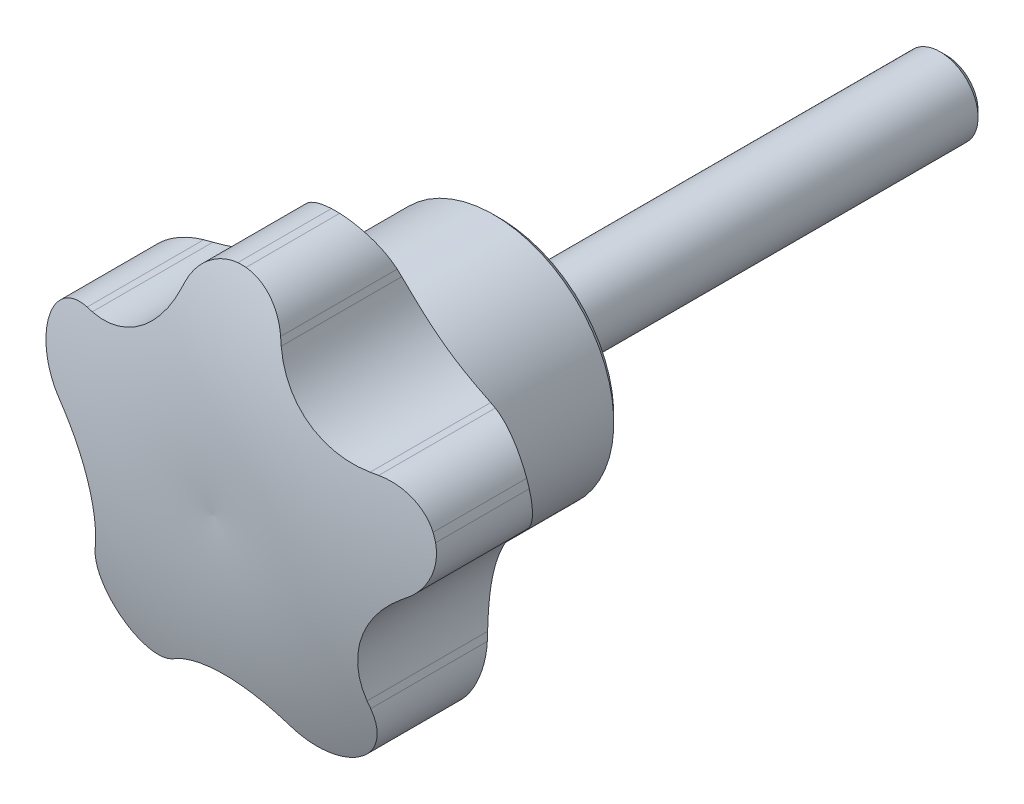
ISO-10303-21;
HEADER;
FILE_DESCRIPTION(('STEP AP214'),'2;1');
FILE_NAME('part.step','',(''),(''),'','','');
FILE_SCHEMA(('AUTOMOTIVE_DESIGN { 1 0 10303 214 1 1 1 1 }'));
ENDSEC;
DATA;
#1=APPLICATION_CONTEXT('core data for automotive mechanical design processes');
#2=APPLICATION_PROTOCOL_DEFINITION('international standard','automotive_design',2000,#1);
#3=PRODUCT_CONTEXT('',#1,'mechanical');
#4=PRODUCT('Part','Part','',(#3));
#5=PRODUCT_RELATED_PRODUCT_CATEGORY('part','',(#4));
#6=PRODUCT_DEFINITION_FORMATION('','',#4);
#7=PRODUCT_DEFINITION_CONTEXT('part definition',#1,'design');
#8=PRODUCT_DEFINITION('design','',#6,#7);
#9=PRODUCT_DEFINITION_SHAPE('','',#8);
#10=(LENGTH_UNIT() NAMED_UNIT(*) SI_UNIT(.MILLI.,.METRE.));
#11=(NAMED_UNIT(*) PLANE_ANGLE_UNIT() SI_UNIT($,.RADIAN.));
#12=(NAMED_UNIT(*) SI_UNIT($,.STERADIAN.) SOLID_ANGLE_UNIT());
#13=UNCERTAINTY_MEASURE_WITH_UNIT(LENGTH_MEASURE(1.E-05),#10,'distance_accuracy_value','');
#14=(GEOMETRIC_REPRESENTATION_CONTEXT(3) GLOBAL_UNCERTAINTY_ASSIGNED_CONTEXT((#13)) GLOBAL_UNIT_ASSIGNED_CONTEXT((#10,
#11,#12)) REPRESENTATION_CONTEXT('',''));
#15=CARTESIAN_POINT('',(0.,0.,0.));
#16=DIRECTION('',(0.,0.,1.));
#17=DIRECTION('',(1.,0.,0.));
#18=AXIS2_PLACEMENT_3D('',#15,#16,#17);
#19=CARTESIAN_POINT('',(0.,0.,0.));
#20=DIRECTION('',(0.,0.,-1.));
#21=DIRECTION('',(-1.,0.,0.));
#22=AXIS2_PLACEMENT_3D('',#19,#20,#21);
#23=CYLINDRICAL_SURFACE('',#22,16.);
#24=CARTESIAN_POINT('',(0.,0.,20.7));
#25=DIRECTION('',(0.,0.,-1.));
#26=DIRECTION('',(-1.,0.,0.));
#27=AXIS2_PLACEMENT_3D('',#24,#25,#26);
#28=CIRCLE('',#27,16.);
#29=CARTESIAN_POINT('',(-15.3145548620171,4.63296982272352,20.7));
#30=VERTEX_POINT('',#29);
#31=CARTESIAN_POINT('',(-15.1129264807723,5.25351817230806,20.7));
#32=VERTEX_POINT('',#31);
#33=EDGE_CURVE('E312',#30,#32,#28,.T.);
#34=ORIENTED_EDGE('',*,*,#33,.T.);
#35=DIRECTION('',(0.,0.,1.));
#36=VECTOR('',#35,1.);
#37=CARTESIAN_POINT('',(-15.1129264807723,5.25351817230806,0.));
#38=LINE('',#37,#36);
#39=CARTESIAN_POINT('',(-15.1129264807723,5.25351817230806,13.2999999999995));
#40=VERTEX_POINT('',#39);
#41=EDGE_CURVE('E592',#32,#40,#38,.F.);
#42=ORIENTED_EDGE('',*,*,#41,.T.);
#43=CARTESIAN_POINT('',(0.,0.,13.3));
#44=DIRECTION('',(0.,0.,-1.));
#45=DIRECTION('',(-1.,0.,0.));
#46=AXIS2_PLACEMENT_3D('',#43,#44,#45);
#47=CIRCLE('',#46,16.);
#48=CARTESIAN_POINT('',(-15.3145548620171,4.63296982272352,13.2999999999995));
#49=VERTEX_POINT('',#48);
#50=EDGE_CURVE('E309',#49,#40,#47,.T.);
#51=ORIENTED_EDGE('',*,*,#50,.F.);
#52=DIRECTION('',(0.,0.,1.));
#53=VECTOR('',#52,1.);
#54=CARTESIAN_POINT('',(-15.3145548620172,4.63296982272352,0.));
#55=LINE('',#54,#53);
#56=EDGE_CURVE('E584',#49,#30,#55,.T.);
#57=ORIENTED_EDGE('',*,*,#56,.T.);
#58=EDGE_LOOP('',(#34,#42,#51,#57));
#59=FACE_BOUND('',#58,.T.);
#60=ADVANCED_FACE('F14',(#59),#23,.T.);
#61=CARTESIAN_POINT('',(-9.1386738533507,-13.1333407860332,20.7));
#62=VERTEX_POINT('',#61);
#63=CARTESIAN_POINT('',(-9.66654380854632,-12.7498208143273,20.7));
#64=VERTEX_POINT('',#63);
#65=EDGE_CURVE('E322',#62,#64,#28,.T.);
#66=ORIENTED_EDGE('',*,*,#65,.T.);
#67=DIRECTION('',(0.,0.,1.));
#68=VECTOR('',#67,1.);
#69=CARTESIAN_POINT('',(-9.6665438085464,-12.7498208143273,0.));
#70=LINE('',#69,#68);
#71=CARTESIAN_POINT('',(-9.66654380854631,-12.7498208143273,13.2999999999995));
#72=VERTEX_POINT('',#71);
#73=EDGE_CURVE('E510',#64,#72,#70,.F.);
#74=ORIENTED_EDGE('',*,*,#73,.T.);
#75=CARTESIAN_POINT('',(-9.13867385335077,-13.1333407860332,13.2999999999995));
#76=VERTEX_POINT('',#75);
#77=EDGE_CURVE('E810',#76,#72,#47,.T.);
#78=ORIENTED_EDGE('',*,*,#77,.F.);
#79=DIRECTION('',(0.,0.,1.));
#80=VECTOR('',#79,1.);
#81=CARTESIAN_POINT('',(-9.13867385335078,-13.1333407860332,0.));
#82=LINE('',#81,#80);
#83=EDGE_CURVE('E502',#76,#62,#82,.T.);
#84=ORIENTED_EDGE('',*,*,#83,.T.);
#85=EDGE_LOOP('',(#66,#74,#78,#84));
#86=FACE_BOUND('',#85,.T.);
#87=ADVANCED_FACE('F835',(#86),#23,.T.);
#88=CARTESIAN_POINT('',(9.6665438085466,-12.7498208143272,20.7));
#89=VERTEX_POINT('',#88);
#90=CARTESIAN_POINT('',(9.13867385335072,-13.1333407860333,20.7));
#91=VERTEX_POINT('',#90);
#92=EDGE_CURVE('E320',#89,#91,#28,.T.);
#93=ORIENTED_EDGE('',*,*,#92,.T.);
#94=DIRECTION('',(0.,0.,1.));
#95=VECTOR('',#94,1.);
#96=CARTESIAN_POINT('',(9.13867385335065,-13.1333407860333,0.));
#97=LINE('',#96,#95);
#98=CARTESIAN_POINT('',(9.1386738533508,-13.1333407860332,13.2999999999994));
#99=VERTEX_POINT('',#98);
#100=EDGE_CURVE('E339',#91,#99,#97,.F.);
#101=ORIENTED_EDGE('',*,*,#100,.T.);
#102=CARTESIAN_POINT('',(9.66654380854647,-12.7498208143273,13.2999999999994));
#103=VERTEX_POINT('',#102);
#104=EDGE_CURVE('E812',#103,#99,#47,.T.);
#105=ORIENTED_EDGE('',*,*,#104,.F.);
#106=DIRECTION('',(0.,0.,1.));
#107=VECTOR('',#106,1.);
#108=CARTESIAN_POINT('',(9.66654380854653,-12.7498208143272,0.));
#109=LINE('',#108,#107);
#110=EDGE_CURVE('E341',#103,#89,#109,.T.);
#111=ORIENTED_EDGE('',*,*,#110,.T.);
#112=EDGE_LOOP('',(#93,#101,#105,#111));
#113=FACE_BOUND('',#112,.T.);
#114=ADVANCED_FACE('F337',(#113),#23,.T.);
#115=CARTESIAN_POINT('',(-0.326241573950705,15.9966736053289,20.7));
#116=VERTEX_POINT('',#115);
#117=CARTESIAN_POINT('',(0.326241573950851,15.9966736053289,20.7));
#118=VERTEX_POINT('',#117);
#119=EDGE_CURVE('E232',#116,#118,#28,.T.);
#120=ORIENTED_EDGE('',*,*,#119,.T.);
#121=DIRECTION('',(0.,0.,1.));
#122=VECTOR('',#121,1.);
#123=CARTESIAN_POINT('',(0.326241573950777,15.9966736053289,0.));
#124=LINE('',#123,#122);
#125=CARTESIAN_POINT('',(0.326241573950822,15.9966736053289,13.2999999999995));
#126=VERTEX_POINT('',#125);
#127=EDGE_CURVE('E671',#118,#126,#124,.F.);
#128=ORIENTED_EDGE('',*,*,#127,.T.);
#129=CARTESIAN_POINT('',(-0.326241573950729,15.9966736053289,13.2999999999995));
#130=VERTEX_POINT('',#129);
#131=EDGE_CURVE('E310',#130,#126,#47,.T.);
#132=ORIENTED_EDGE('',*,*,#131,.F.);
#133=DIRECTION('',(0.,0.,1.));
#134=VECTOR('',#133,1.);
#135=CARTESIAN_POINT('',(-0.326241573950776,15.9966736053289,0.));
#136=LINE('',#135,#134);
#137=EDGE_CURVE('E662',#130,#116,#136,.T.);
#138=ORIENTED_EDGE('',*,*,#137,.T.);
#139=EDGE_LOOP('',(#120,#128,#132,#138));
#140=FACE_BOUND('',#139,.T.);
#141=ADVANCED_FACE('F790',(#140),#23,.T.);
#142=CARTESIAN_POINT('',(-2.59665404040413,0.,-15.7384936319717));
#143=DIRECTION('',(0.,-1.,0.));
#144=DIRECTION('',(-1.,0.,0.));
#145=AXIS2_PLACEMENT_3D('',#142,#143,#144);
#146=CIRCLE('',#145,38.8254233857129);
#147=TRIMMED_CURVE('',#146,(PARAMETER_VALUE(-1.63772653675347)),
(PARAMETER_VALUE(1.63772653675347)),.T.,.PARAMETER.);
#148=CARTESIAN_POINT('',(0.,0.,-15.7384936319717));
#149=DIRECTION('',(0.,0.,-1.));
#150=AXIS1_PLACEMENT('',#148,#149);
#151=SURFACE_OF_REVOLUTION('',#147,#150);
#152=CARTESIAN_POINT('',(0.,0.,23.));
#153=VERTEX_POINT('',#152);
#154=VERTEX_LOOP('',#153);
#155=FACE_BOUND('',#154,.T.);
#156=CARTESIAN_POINT('',(-3.77099647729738,13.3440110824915,21.415260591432));
#157=CARTESIAN_POINT('',(-3.73320410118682,13.4508726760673,21.3871864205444));
#158=CARTESIAN_POINT('',(-3.69082482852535,13.5561957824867,21.3594189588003));
#159=CARTESIAN_POINT('',(-3.59717795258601,13.7630488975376,21.3047121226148));
#160=CARTESIAN_POINT('',(-3.54590951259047,13.8645785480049,21.277772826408));
#161=CARTESIAN_POINT('',(-3.43474465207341,14.0631659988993,21.2249269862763));
#162=CARTESIAN_POINT('',(-3.37484322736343,14.1602211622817,21.1990210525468));
#163=CARTESIAN_POINT('',(-3.24680122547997,14.3490799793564,21.1484760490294));
#164=CARTESIAN_POINT('',(-3.17866104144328,14.4408838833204,21.1238369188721));
#165=CARTESIAN_POINT('',(-3.03449158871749,14.6186333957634,21.0760148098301));
#166=CARTESIAN_POINT('',(-2.95845492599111,14.7045733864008,21.0528332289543));
#167=CARTESIAN_POINT('',(-2.79900496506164,14.869853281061,21.0081525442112));
#168=CARTESIAN_POINT('',(-2.71558910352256,14.9491908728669,20.9866540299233));
#169=CARTESIAN_POINT('',(-2.54199733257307,15.1005508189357,20.9455591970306));
#170=CARTESIAN_POINT('',(-2.45182452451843,15.1725764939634,20.9259620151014));
#171=CARTESIAN_POINT('',(-2.26530938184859,15.3087428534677,20.8888498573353));
#172=CARTESIAN_POINT('',(-2.16896729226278,15.3728838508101,20.8713347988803));
#173=CARTESIAN_POINT('',(-1.97314202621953,15.4913062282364,20.8389499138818));
#174=CARTESIAN_POINT('',(-1.87378667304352,15.5457846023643,20.8240274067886));
#175=CARTESIAN_POINT('',(-1.6705909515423,15.6462016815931,20.7964888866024));
#176=CARTESIAN_POINT('',(-1.56675241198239,15.6921438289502,20.7838719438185));
#177=CARTESIAN_POINT('',(-1.35541384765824,15.7750666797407,20.7610775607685));
#178=CARTESIAN_POINT('',(-1.24791739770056,15.8120558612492,20.7508978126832));
#179=CARTESIAN_POINT('',(-1.03001609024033,15.8767784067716,20.7330730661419));
#180=CARTESIAN_POINT('',(-0.919612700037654,15.9045163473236,20.7254268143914));
#181=CARTESIAN_POINT('',(-0.72716441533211,15.9442185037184,20.7144774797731));
#182=CARTESIAN_POINT('',(-0.645608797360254,15.9584217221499,20.7105585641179));
#183=CARTESIAN_POINT('',(-0.481866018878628,15.9817298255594,20.7041258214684));
#184=CARTESIAN_POINT('',(-0.399680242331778,15.9908437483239,20.7016095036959));
#185=CARTESIAN_POINT('',(-0.317265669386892,15.9973979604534,20.6998));
#186=B_SPLINE_CURVE_WITH_KNOTS('',3,(#156,#157,#158,#159,#160,#161,#162,#163,#164,#165,#166,
#167,#168,#169,#170,#171,#172,#173,#174,#175,#176,#177,#178,#179,#180,#181,#182,#183,#184,#185),
.UNSPECIFIED.,.F.,.F.,(4,2,2,2,2,2,2,2,2,2,2,2,2,2,4),(0.,0.350222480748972,0.700477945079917,
1.05093726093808,1.40137986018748,1.75215361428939,2.10304969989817,2.45378570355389,
2.80450778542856,3.14695123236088,3.48925628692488,3.83123591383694,4.17304611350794,
4.42151117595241,4.66953358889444),.UNSPECIFIED.);
#187=CARTESIAN_POINT('',(-3.77092572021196,13.3442110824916,21.4152080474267));
#188=VERTEX_POINT('',#187);
#189=EDGE_CURVE('E664',#188,#116,#186,.T.);
#190=ORIENTED_EDGE('',*,*,#189,.F.);
#191=CARTESIAN_POINT('',(-3.95260918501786,12.8307129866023,21.5461485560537));
#192=CARTESIAN_POINT('',(-3.92226680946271,12.9164706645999,21.5249399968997));
#193=CARTESIAN_POINT('',(-3.89194943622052,13.0021576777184,21.5034196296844));
#194=CARTESIAN_POINT('',(-3.83136469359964,13.1733903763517,21.4597552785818));
#195=CARTESIAN_POINT('',(-3.8010973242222,13.258936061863,21.4376112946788));
#196=CARTESIAN_POINT('',(-3.77085495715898,13.3444110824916,21.415155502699));
#197=B_SPLINE_CURVE_WITH_KNOTS('',3,(#191,#192,#193,#194,#195,#196),.UNSPECIFIED.,.F.,.F.,(4,2,
4),(0.,0.280215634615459,0.560431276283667),.UNSPECIFIED.);
#198=CARTESIAN_POINT('',(-3.9525384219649,12.8309129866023,21.5460990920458));
#199=VERTEX_POINT('',#198);
#200=EDGE_CURVE('E651',#199,#188,#197,.T.);
#201=ORIENTED_EDGE('',*,*,#200,.F.);
#202=CARTESIAN_POINT('',(-3.95246766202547,12.8311129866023,21.5460496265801));
#203=CARTESIAN_POINT('',(-4.01935057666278,12.6419853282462,21.5928356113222));
#204=CARTESIAN_POINT('',(-4.093930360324,12.454862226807,21.6367985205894));
#205=CARTESIAN_POINT('',(-4.25814425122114,12.0859801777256,21.7188765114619));
#206=CARTESIAN_POINT('',(-4.34778093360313,11.9042221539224,21.7569905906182));
#207=CARTESIAN_POINT('',(-4.54179627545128,11.5473986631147,21.8271712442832));
#208=CARTESIAN_POINT('',(-4.64618254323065,11.3723367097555,21.859234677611));
#209=CARTESIAN_POINT('',(-4.86909539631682,11.030392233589,21.9171386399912));
#210=CARTESIAN_POINT('',(-4.9876208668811,10.8635090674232,21.9429796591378));
#211=CARTESIAN_POINT('',(-5.23830361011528,10.5389870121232,21.988369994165));
#212=CARTESIAN_POINT('',(-5.3704814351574,10.3813626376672,22.0079096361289));
#213=CARTESIAN_POINT('',(-5.64745186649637,10.0768963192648,22.0405756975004));
#214=CARTESIAN_POINT('',(-5.79224454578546,9.93005443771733,22.0537020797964));
#215=CARTESIAN_POINT('',(-6.09330700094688,9.64843857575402,22.0734952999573));
#216=CARTESIAN_POINT('',(-6.24956704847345,9.5136545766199,22.0801675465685));
#217=CARTESIAN_POINT('',(-6.57253039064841,9.25706710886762,22.0870549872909));
#218=CARTESIAN_POINT('',(-6.7392333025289,9.13526316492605,22.0872704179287));
#219=CARTESIAN_POINT('',(-7.07799217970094,8.90812281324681,22.0813121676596));
#220=CARTESIAN_POINT('',(-7.2498442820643,8.80247838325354,22.0752816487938));
#221=CARTESIAN_POINT('',(-7.60108680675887,8.60518068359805,22.0570643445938));
#222=CARTESIAN_POINT('',(-7.78047715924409,8.51352728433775,22.0448776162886));
#223=CARTESIAN_POINT('',(-8.14556763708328,8.34474401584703,22.0143736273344));
#224=CARTESIAN_POINT('',(-8.33127092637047,8.26762155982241,21.9960532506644));
#225=CARTESIAN_POINT('',(-8.70752265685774,8.1283893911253,21.953343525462));
#226=CARTESIAN_POINT('',(-8.8980704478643,8.06627767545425,21.9289549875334));
#227=CARTESIAN_POINT('',(-9.2455117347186,7.96784147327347,21.8794896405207));
#228=CARTESIAN_POINT('',(-9.40180657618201,7.92885382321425,21.8554531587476));
#229=CARTESIAN_POINT('',(-9.71593106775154,7.86088893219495,21.8035583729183));
#230=CARTESIAN_POINT('',(-9.87376067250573,7.83191139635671,21.7757001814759));
#231=CARTESIAN_POINT('',(-10.1899340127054,7.78402260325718,21.7163039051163));
#232=CARTESIAN_POINT('',(-10.3482762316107,7.76509259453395,21.6847728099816));
#233=CARTESIAN_POINT('',(-10.6650823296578,7.7371501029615,21.6180962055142));
#234=CARTESIAN_POINT('',(-10.8235462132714,7.72813800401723,21.5829505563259));
#235=CARTESIAN_POINT('',(-10.981721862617,7.72405240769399,21.5460524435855));
#236=B_SPLINE_CURVE_WITH_KNOTS('',3,(#202,#203,#204,#205,#206,#207,#208,#209,#210,#211,#212,
#213,#214,#215,#216,#217,#218,#219,#220,#221,#222,#223,#224,#225,#226,#227,#228,#229,#230,#231,
#232,#233,#234,#235),.UNSPECIFIED.,.F.,.F.,(4,2,2,2,2,2,2,2,2,2,2,2,2,2,2,2,4),(0.,
0.617822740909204,1.23575125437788,1.85399968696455,2.47219940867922,3.0913437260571,
3.71049162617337,4.32912021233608,4.94772613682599,5.55246035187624,6.15718896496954,
6.76222526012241,7.36718077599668,7.85543723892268,8.34367931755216,8.83100696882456,
9.31835348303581),.UNSPECIFIED.);
#237=CARTESIAN_POINT('',(-10.981521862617,7.72405758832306,21.5460990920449));
#238=VERTEX_POINT('',#237);
#239=EDGE_CURVE('E643',#199,#238,#236,.T.);
#240=ORIENTED_EDGE('',*,*,#239,.T.);
#241=CARTESIAN_POINT('',(-11.5260187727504,7.70994629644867,21.4151584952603));
#242=CARTESIAN_POINT('',(-11.4353858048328,7.71229515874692,21.4376132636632));
#243=CARTESIAN_POINT('',(-11.3446779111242,7.71464596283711,21.4597562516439));
#244=CARTESIAN_POINT('',(-11.1631122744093,7.71935145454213,21.5034186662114));
#245=CARTESIAN_POINT('',(-11.0722545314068,7.72170614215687,21.5249380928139));
#246=CARTESIAN_POINT('',(-10.981321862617,7.72406277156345,21.54614573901));
#247=B_SPLINE_CURVE_WITH_KNOTS('',3,(#241,#242,#243,#244,#245,#246),.UNSPECIFIED.,.F.,.F.,(4,2,
4),(0.,0.280203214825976,0.560406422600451),.UNSPECIFIED.);
#248=CARTESIAN_POINT('',(-11.5258187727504,7.70995147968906,21.4152080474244));
#249=VERTEX_POINT('',#248);
#250=EDGE_CURVE('E652',#249,#238,#247,.T.);
#251=ORIENTED_EDGE('',*,*,#250,.F.);
#252=CARTESIAN_POINT('',(-15.1163890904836,5.24520541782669,20.6998));
#253=CARTESIAN_POINT('',(-15.0741587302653,5.34694466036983,20.7022082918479));
#254=CARTESIAN_POINT('',(-15.0277158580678,5.44689641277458,20.7058758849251));
#255=CARTESIAN_POINT('',(-14.9268181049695,5.64252631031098,20.7156733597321));
#256=CARTESIAN_POINT('',(-14.8723644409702,5.73820510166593,20.7218028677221));
#257=CARTESIAN_POINT('',(-14.7559576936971,5.92444153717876,20.7364544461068));
#258=CARTESIAN_POINT('',(-14.6940193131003,6.0150087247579,20.7449718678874));
#259=CARTESIAN_POINT('',(-14.5630725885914,6.19058003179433,20.7643130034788));
#260=CARTESIAN_POINT('',(-14.4940641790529,6.27558409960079,20.7751367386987));
#261=CARTESIAN_POINT('',(-14.2772082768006,6.52136213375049,20.8109202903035));
#262=CARTESIAN_POINT('',(-14.1194134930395,6.67308773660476,20.839207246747));
#263=CARTESIAN_POINT('',(-13.7822732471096,6.94817964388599,20.9035773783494));
#264=CARTESIAN_POINT('',(-13.6029206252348,7.07153648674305,20.9396631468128));
#265=CARTESIAN_POINT('',(-13.2240833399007,7.28925783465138,21.0191498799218));
#266=CARTESIAN_POINT('',(-13.0242746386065,7.38301095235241,21.0626796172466));
#267=CARTESIAN_POINT('',(-12.6131370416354,7.53617382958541,21.1550869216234));
#268=CARTESIAN_POINT('',(-12.4018144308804,7.5956021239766,21.2039615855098));
#269=CARTESIAN_POINT('',(-12.0782654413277,7.65870241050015,21.280639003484));
#270=CARTESIAN_POINT('',(-11.968101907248,7.67542891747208,21.3070616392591));
#271=CARTESIAN_POINT('',(-11.747194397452,7.69961177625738,21.3606418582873));
#272=CARTESIAN_POINT('',(-11.6364521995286,7.70708816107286,21.3877977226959));
#273=CARTESIAN_POINT('',(-11.5256187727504,7.70995665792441,21.4152575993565));
#274=B_SPLINE_CURVE_WITH_KNOTS('',3,(#252,#253,#254,#255,#256,#257,#258,#259,#260,#261,#262,
#263,#264,#265,#266,#267,#268,#269,#270,#271,#272,#273),.UNSPECIFIED.,.F.,.F.,(4,2,2,2,2,2,2,2,
2,2,4),(0.,0.330431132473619,0.660812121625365,0.990554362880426,1.32029966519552,
1.97913896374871,2.63819768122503,3.31009108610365,3.98162133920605,4.32484055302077,
4.66731514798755),.UNSPECIFIED.);
#275=EDGE_CURVE('E802',#32,#249,#274,.T.);
#276=ORIENTED_EDGE('',*,*,#275,.F.);
#277=ORIENTED_EDGE('',*,*,#33,.F.);
#278=CARTESIAN_POINT('',(-13.8561182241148,0.537024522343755,21.4152894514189));
#279=CARTESIAN_POINT('',(-13.9460733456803,0.605986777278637,21.387215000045));
#280=CARTESIAN_POINT('',(-14.0331479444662,0.678836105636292,21.3594472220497));
#281=CARTESIAN_POINT('',(-14.2009432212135,0.831816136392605,21.3047396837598));
#282=CARTESIAN_POINT('',(-14.2816633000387,0.911947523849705,21.277800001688));
#283=CARTESIAN_POINT('',(-14.4361844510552,1.07903433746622,21.2249533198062));
#284=CARTESIAN_POINT('',(-14.5099814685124,1.16599370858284,21.1990469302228));
#285=CARTESIAN_POINT('',(-14.6500351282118,1.34612577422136,21.1485009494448));
#286=CARTESIAN_POINT('',(-14.716292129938,1.43929817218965,21.123861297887));
#287=CARTESIAN_POINT('',(-14.8407968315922,1.63133585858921,21.0760380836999));
#288=CARTESIAN_POINT('',(-14.8990369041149,1.73020644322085,21.0528559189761));
#289=CARTESIAN_POINT('',(-15.0069606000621,1.93292392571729,21.008174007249));
#290=CARTESIAN_POINT('',(-15.0566412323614,2.03677254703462,20.9866748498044));
#291=CARTESIAN_POINT('',(-15.1469564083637,2.24863870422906,20.9455786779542));
#292=CARTESIAN_POINT('',(-15.187595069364,2.35665431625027,20.9259808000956));
#293=CARTESIAN_POINT('',(-15.2594669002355,2.57611679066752,20.8888672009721));
#294=CARTESIAN_POINT('',(-15.2907004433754,2.6875635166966,20.8713513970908));
#295=CARTESIAN_POINT('',(-15.3428198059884,2.9103978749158,20.8389649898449));
#296=CARTESIAN_POINT('',(-15.3639324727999,3.02172480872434,20.8240417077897));
#297=CARTESIAN_POINT('',(-15.3966501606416,3.24600555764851,20.7965016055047));
#298=CARTESIAN_POINT('',(-15.4082590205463,3.35895869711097,20.7838838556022));
#299=CARTESIAN_POINT('',(-15.4218224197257,3.58557832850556,20.7610878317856));
#300=CARTESIAN_POINT('',(-15.4237861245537,3.69924404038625,20.750907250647));
#301=CARTESIAN_POINT('',(-15.4180119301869,3.92648160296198,20.733080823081));
#302=CARTESIAN_POINT('',(-15.4102788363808,4.04005347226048,20.7254337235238));
#303=CARTESIAN_POINT('',(-15.3885713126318,4.23537020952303,20.7144819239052));
#304=CARTESIAN_POINT('',(-15.3768764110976,4.31734145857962,20.7105616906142));
#305=CARTESIAN_POINT('',(-15.3484404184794,4.48030878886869,20.7041269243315));
#306=CARTESIAN_POINT('',(-15.33170835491,4.56130634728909,20.7016098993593));
#307=CARTESIAN_POINT('',(-15.3124700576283,4.64173025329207,20.6998));
#308=B_SPLINE_CURVE_WITH_KNOTS('',3,(#278,#279,#280,#281,#282,#283,#284,#285,#286,#287,#288,
#289,#290,#291,#292,#293,#294,#295,#296,#297,#298,#299,#300,#301,#302,#303,#304,#305,#306,#307),
.UNSPECIFIED.,.F.,.F.,(4,2,2,2,2,2,2,2,2,2,2,2,2,2,4),(0.,0.350223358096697,0.700479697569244,
1.05093991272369,1.40138341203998,1.75215805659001,2.10305503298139,2.45379189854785,
2.80451484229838,3.14695926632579,3.48926529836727,3.83124598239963,4.17305725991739,
4.42157679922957,4.66965357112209),.UNSPECIFIED.);
#309=CARTESIAN_POINT('',(-13.8563790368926,0.537224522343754,21.4152080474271));
#310=VERTEX_POINT('',#309);
#311=EDGE_CURVE('E586',#310,#30,#308,.T.);
#312=ORIENTED_EDGE('',*,*,#311,.F.);
#313=CARTESIAN_POINT('',(-13.4241249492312,0.205729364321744,21.5461578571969));
#314=CARTESIAN_POINT('',(-13.4963196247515,0.261095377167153,21.5249462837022));
#315=CARTESIAN_POINT('',(-13.5684548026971,0.316415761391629,21.5034228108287));
#316=CARTESIAN_POINT('',(-13.7126061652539,0.426965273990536,21.459752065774));
#317=CARTESIAN_POINT('',(-13.7846223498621,0.48219440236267,21.4376047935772));
#318=CARTESIAN_POINT('',(-13.8565790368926,0.537377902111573,21.4151456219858));
#319=B_SPLINE_CURVE_WITH_KNOTS('',3,(#313,#314,#315,#316,#317,#318),.UNSPECIFIED.,.F.,.F.,(4,2,
4),(0.,0.280256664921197,0.560513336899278),.UNSPECIFIED.);
#320=CARTESIAN_POINT('',(-13.4243249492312,0.205882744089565,21.5460990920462));
#321=VERTEX_POINT('',#320);
#322=EDGE_CURVE('E573',#321,#310,#319,.T.);
#323=ORIENTED_EDGE('',*,*,#322,.F.);
#324=CARTESIAN_POINT('',(-13.4245249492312,0.206036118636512,21.546040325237));
#325=CARTESIAN_POINT('',(-13.265321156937,0.0839838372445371,21.5928267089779));
#326=CARTESIAN_POINT('',(-13.1104022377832,-0.0447691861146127,21.6367900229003));
#327=CARTESIAN_POINT('',(-12.8103179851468,-0.314935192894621,21.7188688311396));
#328=CARTESIAN_POINT('',(-12.66515432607,-0.456350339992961,21.7569833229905));
#329=CARTESIAN_POINT('',(-12.3857474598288,-0.751133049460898,21.8271648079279));
#330=CARTESIAN_POINT('',(-12.2515099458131,-0.904506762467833,21.8592286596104));
#331=CARTESIAN_POINT('',(-11.9951835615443,-1.22217492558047,21.9171334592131));
#332=CARTESIAN_POINT('',(-11.8730937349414,-1.38646851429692,21.9429748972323));
#333=CARTESIAN_POINT('',(-11.6419183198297,-1.72516375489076,21.9883660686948));
#334=CARTESIAN_POINT('',(-11.5328528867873,-1.89958046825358,22.0079061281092));
#335=CARTESIAN_POINT('',(-11.3288748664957,-2.2570794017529,22.0405730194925));
#336=CARTESIAN_POINT('',(-11.2339623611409,-2.44016167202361,22.0536998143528));
#337=CARTESIAN_POINT('',(-11.0591612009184,-2.81351248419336,22.0734938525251));
#338=CARTESIAN_POINT('',(-10.9792600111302,-3.00377486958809,22.0801665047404));
#339=CARTESIAN_POINT('',(-10.8350299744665,-3.3902206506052,22.0870547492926));
#340=CARTESIAN_POINT('',(-10.7707005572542,-3.58640382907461,22.0872705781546));
#341=CARTESIAN_POINT('',(-10.6593575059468,-3.97877251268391,22.0813131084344));
#342=CARTESIAN_POINT('',(-10.611987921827,-4.17485931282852,22.0752829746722));
#343=CARTESIAN_POINT('',(-10.5328845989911,-4.56987886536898,22.0570664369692));
#344=CARTESIAN_POINT('',(-10.501150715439,-4.768811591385,22.0448800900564));
#345=CARTESIAN_POINT('',(-10.453445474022,-5.16819007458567,22.0143768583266));
#346=CARTESIAN_POINT('',(-10.4374821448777,-5.36863655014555,21.9960568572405));
#347=CARTESIAN_POINT('',(-10.4213307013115,-5.76949841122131,21.9533478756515));
#348=CARTESIAN_POINT('',(-10.4211404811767,-5.96991379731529,21.9289597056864));
#349=CARTESIAN_POINT('',(-10.4348857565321,-6.33077257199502,21.8794944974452));
#350=CARTESIAN_POINT('',(-10.4461036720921,-6.49146953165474,21.8554576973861));
#351=CARTESIAN_POINT('',(-10.4785347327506,-6.81122971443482,21.8035620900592));
#352=CARTESIAN_POINT('',(-10.4997475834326,-6.97029298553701,21.7757033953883));
#353=CARTESIAN_POINT('',(-10.5519062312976,-7.28579775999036,21.7163059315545));
#354=CARTESIAN_POINT('',(-10.5828337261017,-7.44224361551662,21.6847741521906));
#355=CARTESIAN_POINT('',(-10.6541588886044,-7.75218620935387,21.618096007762));
#356=CARTESIAN_POINT('',(-10.6945569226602,-7.90568283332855,21.5829495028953));
#357=CARTESIAN_POINT('',(-10.7395514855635,-8.05738286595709,21.5460504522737));
#358=B_SPLINE_CURVE_WITH_KNOTS('',3,(#324,#325,#326,#327,#328,#329,#330,#331,#332,#333,#334,
#335,#336,#337,#338,#339,#340,#341,#342,#343,#344,#345,#346,#347,#348,#349,#350,#351,#352,#353,
#354,#355,#356,#357),.UNSPECIFIED.,.F.,.F.,(4,2,2,2,2,2,2,2,2,2,2,2,2,2,2,2,4),(0.,
0.617823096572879,1.23575196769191,1.85400078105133,2.47220088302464,3.09134559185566,
3.71049388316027,4.32912284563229,4.94772914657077,5.55246347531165,6.15719220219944,
6.76222863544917,7.36718429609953,7.85545229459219,8.34370591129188,8.83104512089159,
9.31840318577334),.UNSPECIFIED.);
#359=CARTESIAN_POINT('',(-10.7394921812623,-8.05718286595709,21.5460990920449));
#360=VERTEX_POINT('',#359);
#361=EDGE_CURVE('E565',#321,#360,#358,.T.);
#362=ORIENTED_EDGE('',*,*,#361,.T.);
#363=CARTESIAN_POINT('',(-10.8943327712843,-8.57939901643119,21.4151563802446));
#364=CARTESIAN_POINT('',(-10.8685587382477,-8.4924733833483,21.4376118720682));
#365=CARTESIAN_POINT('',(-10.8427633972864,-8.40547588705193,21.4597555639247));
#366=CARTESIAN_POINT('',(-10.7911301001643,-8.23133717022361,21.5034193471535));
#367=CARTESIAN_POINT('',(-10.7652921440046,-8.14419594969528,21.5249394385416));
#368=CARTESIAN_POINT('',(-10.7394328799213,-8.05698286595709,21.5461477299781));
#369=B_SPLINE_CURVE_WITH_KNOTS('',3,(#363,#364,#365,#366,#367,#368),.UNSPECIFIED.,.F.,.F.,(4,2,
4),(0.,0.280211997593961,0.56042398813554),.UNSPECIFIED.);
#370=CARTESIAN_POINT('',(-10.8942734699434,-8.57919901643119,21.4152080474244));
#371=VERTEX_POINT('',#370);
#372=EDGE_CURVE('E574',#371,#360,#369,.T.);
#373=ORIENTED_EDGE('',*,*,#372,.F.);
#374=CARTESIAN_POINT('',(-9.6597079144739,-12.7556827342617,20.6998));
#375=CARTESIAN_POINT('',(-9.74341778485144,-12.6840801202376,20.7022082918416));
#376=CARTESIAN_POINT('',(-9.82412591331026,-12.6090235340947,20.7058758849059));
#377=CARTESIAN_POINT('',(-9.97900188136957,-12.4526111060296,20.715673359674));
#378=CARTESIAN_POINT('',(-10.0531707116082,-12.3712562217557,20.7218028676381));
#379=CARTESIAN_POINT('',(-10.19432042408,-12.2029966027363,20.7364544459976));
#380=CARTESIAN_POINT('',(-10.2613149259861,-12.1161029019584,20.7449718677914));
#381=CARTESIAN_POINT('',(-10.38782839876,-11.9373106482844,20.7643130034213));
#382=CARTESIAN_POINT('',(-10.4473473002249,-11.8454120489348,20.7751367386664));
#383=CARTESIAN_POINT('',(-10.6140839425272,-11.5632202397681,20.8109202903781));
#384=CARTESIAN_POINT('',(-10.7096222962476,-11.3662626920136,20.8392072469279));
#385=CARTESIAN_POINT('',(-10.8670681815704,-10.9606151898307,20.9035773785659));
#386=CARTESIAN_POINT('',(-10.9289645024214,-10.7519213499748,20.9396631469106));
#387=CARTESIAN_POINT('',(-11.018962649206,-10.3243460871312,21.0191498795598));
#388=CARTESIAN_POINT('',(-11.0463828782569,-10.1053454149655,21.0626796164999));
#389=CARTESIAN_POINT('',(-11.0650009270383,-9.66700039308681,21.1550869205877));
#390=CARTESIAN_POINT('',(-11.0562183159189,-9.44765629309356,21.2039615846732));
#391=CARTESIAN_POINT('',(-11.0162479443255,-9.12044243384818,21.2806393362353));
#392=CARTESIAN_POINT('',(-10.9981131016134,-9.01050051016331,21.3070623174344));
#393=CARTESIAN_POINT('',(-10.9528473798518,-8.79292933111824,21.3606432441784));
#394=CARTESIAN_POINT('',(-10.9257361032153,-8.68529557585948,21.3877994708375));
#395=CARTESIAN_POINT('',(-10.8942141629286,-8.57899901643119,21.4152597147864));
#396=B_SPLINE_CURVE_WITH_KNOTS('',3,(#374,#375,#376,#377,#378,#379,#380,#381,#382,#383,#384,
#385,#386,#387,#388,#389,#390,#391,#392,#393,#394,#395),.UNSPECIFIED.,.F.,.F.,(4,2,2,2,2,2,2,2,
2,2,4),(0.,0.33043113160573,0.660812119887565,0.990554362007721,1.32029966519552,
1.97913896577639,2.63819768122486,3.31009107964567,3.98162133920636,4.32484495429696,
4.66732393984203),.UNSPECIFIED.);
#397=EDGE_CURVE('E1143',#64,#371,#396,.T.);
#398=ORIENTED_EDGE('',*,*,#397,.F.);
#399=ORIENTED_EDGE('',*,*,#65,.F.);
#400=CARTESIAN_POINT('',(-4.79258748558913,-13.0120505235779,21.4152681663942));
#401=CARTESIAN_POINT('',(-4.88597338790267,-13.0762903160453,21.3871939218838));
#402=CARTESIAN_POINT('',(-4.98216589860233,-13.1365893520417,21.3594263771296));
#403=CARTESIAN_POINT('',(-5.17951226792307,-13.2488943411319,21.3047193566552));
#404=CARTESIAN_POINT('',(-5.28066659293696,-13.3008995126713,21.2777799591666));
#405=CARTESIAN_POINT('',(-5.48732700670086,-13.3962206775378,21.2249338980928));
#406=CARTESIAN_POINT('',(-5.59283559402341,-13.4395315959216,21.1990278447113));
#407=CARTESIAN_POINT('',(-5.80743169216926,-13.517062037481,21.1484825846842));
#408=CARTESIAN_POINT('',(-5.9165190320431,-13.5512819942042,21.1238433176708));
#409=CARTESIAN_POINT('',(-6.13763276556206,-13.610345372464,21.0760209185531));
#410=CARTESIAN_POINT('',(-6.24966183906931,-13.6351799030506,21.0528391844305));
#411=CARTESIAN_POINT('',(-6.47580844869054,-13.6751735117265,21.0081581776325));
#412=CARTESIAN_POINT('',(-6.58992669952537,-13.6903292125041,20.986659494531));
#413=CARTESIAN_POINT('',(-6.81933247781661,-13.710749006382,20.9455643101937));
#414=CARTESIAN_POINT('',(-6.93461944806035,-13.7160176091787,20.9259669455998));
#415=CARTESIAN_POINT('',(-7.16555003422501,-13.7165493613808,20.8888544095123));
#416=CARTESIAN_POINT('',(-7.28119363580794,-13.7118129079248,20.8713391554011));
#417=CARTESIAN_POINT('',(-7.50922677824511,-13.6925170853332,20.8389538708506));
#418=CARTESIAN_POINT('',(-7.62162869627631,-13.6781922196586,20.8240311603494));
#419=CARTESIAN_POINT('',(-7.84504156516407,-13.6399975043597,20.7964922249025));
#420=CARTESIAN_POINT('',(-7.95605305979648,-13.6161315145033,20.7838750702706));
#421=CARTESIAN_POINT('',(-8.17577092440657,-13.5589973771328,20.7610802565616));
#422=CARTESIAN_POINT('',(-8.28447938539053,-13.5257381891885,20.7509002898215));
#423=CARTESIAN_POINT('',(-8.49880889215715,-13.4500221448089,20.7330751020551));
#424=CARTESIAN_POINT('',(-8.60443144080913,-13.4075698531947,20.7254286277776));
#425=CARTESIAN_POINT('',(-8.78346669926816,-13.3265705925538,20.7144786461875));
#426=CARTESIAN_POINT('',(-8.85779949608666,-13.2901223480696,20.7105593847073));
#427=CARTESIAN_POINT('',(-9.00397903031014,-13.2127294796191,20.704126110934));
#428=CARTESIAN_POINT('',(-9.07582996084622,-13.1717929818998,20.7016096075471));
#429=CARTESIAN_POINT('',(-9.14636127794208,-13.1286508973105,20.6998));
#430=B_SPLINE_CURVE_WITH_KNOTS('',3,(#400,#401,#402,#403,#404,#405,#406,#407,#408,#409,#410,
#411,#412,#413,#414,#415,#416,#417,#418,#419,#420,#421,#422,#423,#424,#425,#426,#427,#428,#429),
.UNSPECIFIED.,.F.,.F.,(4,2,2,2,2,2,2,2,2,2,2,2,2,2,4),(0.,0.35022271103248,0.700478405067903,
1.05093795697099,1.40138079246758,1.75215478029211,2.10305109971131,2.45378732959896,
2.80450963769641,3.14695334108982,3.48925865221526,3.83123855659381,4.17304903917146,
4.42152840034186,4.66956508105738),.UNSPECIFIED.);
#431=CARTESIAN_POINT('',(-4.79278748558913,-13.0121880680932,21.415208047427));
#432=VERTEX_POINT('',#431);
#433=EDGE_CURVE('E504',#432,#62,#430,.T.);
#434=ORIENTED_EDGE('',*,*,#433,.F.);
#435=CARTESIAN_POINT('',(-4.34395067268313,-12.7035329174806,21.5461556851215));
#436=CARTESIAN_POINT('',(-4.41891369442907,-12.7550833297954,21.524944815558));
#437=CARTESIAN_POINT('',(-4.49381493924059,-12.8065912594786,21.503422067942));
#438=CARTESIAN_POINT('',(-4.64349387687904,-12.9095221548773,21.4597528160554));
#439=CARTESIAN_POINT('',(-4.71827156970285,-12.9609451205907,21.4376063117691));
#440=CARTESIAN_POINT('',(-4.79298748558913,-13.0123256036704,21.4151479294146));
#441=B_SPLINE_CURVE_WITH_KNOTS('',3,(#435,#436,#437,#438,#439,#440),.UNSPECIFIED.,.F.,.F.,(4,2,
4),(0.,0.280247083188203,0.560494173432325),.UNSPECIFIED.);
#442=CARTESIAN_POINT('',(-4.34415067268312,-12.7036704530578,21.5460990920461));
#443=VERTEX_POINT('',#442);
#444=EDGE_CURVE('E496',#443,#432,#441,.T.);
#445=ORIENTED_EDGE('',*,*,#444,.F.);
#446=CARTESIAN_POINT('',(-4.34435067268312,-12.7038079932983,21.5460424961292));
#447=CARTESIAN_POINT('',(-4.1790752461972,-12.5901126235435,21.5928287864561));
#448=CARTESIAN_POINT('',(-4.00875114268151,-12.4825630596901,21.6367920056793));
#449=CARTESIAN_POINT('',(-3.65907664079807,-12.2806522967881,21.7188706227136));
#450=CARTESIAN_POINT('',(-3.47972470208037,-12.1862933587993,21.7569850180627));
#451=CARTESIAN_POINT('',(-3.11302802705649,-12.0116549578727,21.8271663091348));
#452=CARTESIAN_POINT('',(-2.92567920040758,-11.9313828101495,21.8592300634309));
#453=CARTESIAN_POINT('',(-2.54434946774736,-11.7857672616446,21.9171346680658));
#454=CARTESIAN_POINT('',(-2.35036908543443,-11.7204226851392,21.9429760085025));
#455=CARTESIAN_POINT('',(-1.95681353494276,-11.6052248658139,21.9883669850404));
#456=CARTESIAN_POINT('',(-1.75723027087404,-11.5553954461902,22.0079069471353));
#457=CARTESIAN_POINT('',(-1.35419584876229,-11.471874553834,22.0405736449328));
#458=CARTESIAN_POINT('',(-1.15074466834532,-11.4381831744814,22.0537003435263));
#459=CARTESIAN_POINT('',(-0.741650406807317,-11.3873096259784,22.0734941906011));
#460=CARTESIAN_POINT('',(-0.5360093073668,-11.370113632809,22.0801667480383));
#461=CARTESIAN_POINT('',(-0.123908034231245,-11.3523615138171,22.0870548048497));
#462=CARTESIAN_POINT('',(0.0825521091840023,-11.3518047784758,22.0872705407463));
#463=CARTESIAN_POINT('',(0.490123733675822,-11.3671603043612,22.081312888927));
#464=CARTESIAN_POINT('',(0.691251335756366,-11.38270353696,22.0752826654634));
#465=CARTESIAN_POINT('',(1.09138143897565,-11.4295400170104,22.0570659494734));
#466=CARTESIAN_POINT('',(1.29038395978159,-11.4608331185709,22.0448795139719));
#467=CARTESIAN_POINT('',(1.68495707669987,-11.5388779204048,22.014376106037));
#468=CARTESIAN_POINT('',(1.88052587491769,-11.5856374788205,21.9960560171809));
#469=CARTESIAN_POINT('',(2.26675907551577,-11.6941501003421,21.9533468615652));
#470=CARTESIAN_POINT('',(2.45742412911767,-11.7559011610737,21.9289586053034));
#471=CARTESIAN_POINT('',(2.79637556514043,-11.8804863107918,21.8794929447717));
#472=CARTESIAN_POINT('',(2.94574283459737,-11.9408143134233,21.8554557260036));
#473=CARTESIAN_POINT('',(3.23983475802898,-12.0704717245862,21.8035591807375));
#474=CARTESIAN_POINT('',(3.38455954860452,-12.1398008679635,21.7756999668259));
#475=CARTESIAN_POINT('',(3.66850787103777,-12.2869057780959,21.7163013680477));
#476=CARTESIAN_POINT('',(3.80774119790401,-12.3646654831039,21.6847689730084));
#477=CARTESIAN_POINT('',(4.08047644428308,-12.5282804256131,21.6180895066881));
#478=CARTESIAN_POINT('',(4.21397814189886,-12.6141359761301,21.58294229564));
#479=CARTESIAN_POINT('',(4.3443506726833,-12.7038079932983,21.5460424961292));
#480=B_SPLINE_CURVE_WITH_KNOTS('',3,(#446,#447,#448,#449,#450,#451,#452,#453,#454,#455,#456,
#457,#458,#459,#460,#461,#462,#463,#464,#465,#466,#467,#468,#469,#470,#471,#472,#473,#474,#475,
#476,#477,#478,#479),.UNSPECIFIED.,.F.,.F.,(4,2,2,2,2,2,2,2,2,2,2,2,2,2,2,2,4),(0.,
0.617823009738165,1.23575179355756,1.85400052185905,2.47220053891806,3.091345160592,
3.71049336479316,4.329122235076,4.94772844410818,5.55246273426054,6.15719142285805,
6.76222783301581,7.36718347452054,7.85545804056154,8.34371822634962,8.83106401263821,
9.31842864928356),.UNSPECIFIED.);
#481=CARTESIAN_POINT('',(4.34415067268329,-12.7036704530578,21.5460990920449));
#482=VERTEX_POINT('',#481);
#483=EDGE_CURVE('E355',#443,#482,#480,.T.);
#484=ORIENTED_EDGE('',*,*,#483,.T.);
#485=CARTESIAN_POINT('',(4.79298748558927,-13.0123256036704,21.4151479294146));
#486=CARTESIAN_POINT('',(4.71827156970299,-12.9609451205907,21.4376063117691));
#487=CARTESIAN_POINT('',(4.64349387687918,-12.9095221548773,21.4597528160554));
#488=CARTESIAN_POINT('',(4.49381493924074,-12.8065912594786,21.5034220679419));
#489=CARTESIAN_POINT('',(4.41891369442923,-12.7550833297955,21.5249448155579));
#490=CARTESIAN_POINT('',(4.3439506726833,-12.7035329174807,21.5461556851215));
#491=B_SPLINE_CURVE_WITH_KNOTS('',3,(#485,#486,#487,#488,#489,#490),.UNSPECIFIED.,.F.,.F.,(4,2,
4),(0.,0.280247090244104,0.560494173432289),.UNSPECIFIED.);
#492=CARTESIAN_POINT('',(4.79278748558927,-13.0121880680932,21.4152080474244));
#493=VERTEX_POINT('',#492);
#494=EDGE_CURVE('E351',#493,#482,#491,.T.);
#495=ORIENTED_EDGE('',*,*,#494,.F.);
#496=CARTESIAN_POINT('',(9.14636127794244,-13.1286508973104,20.6998));
#497=CARTESIAN_POINT('',(9.05239537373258,-13.1861372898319,20.7022082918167));
#498=CARTESIAN_POINT('',(8.95607213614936,-13.2397015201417,20.705875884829));
#499=CARTESIAN_POINT('',(8.75945577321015,-13.3386632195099,20.715673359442));
#500=CARTESIAN_POINT('',(8.6591632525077,-13.384061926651,20.721802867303));
#501=CARTESIAN_POINT('',(8.4555211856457,-13.4663081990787,20.7364544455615));
#502=CARTESIAN_POINT('',(8.35217792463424,-13.5031721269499,20.7449718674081));
#503=CARTESIAN_POINT('',(8.14304157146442,-13.5682437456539,20.7643130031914));
#504=CARTESIAN_POINT('',(8.03724845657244,-13.596451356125,20.7751367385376));
#505=CARTESIAN_POINT('',(7.71734363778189,-13.667825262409,20.8109202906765));
#506=CARTESIAN_POINT('',(7.50050290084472,-13.6978244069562,20.8392072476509));
#507=CARTESIAN_POINT('',(7.06605574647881,-13.7222123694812,20.9035773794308));
#508=CARTESIAN_POINT('',(6.84844909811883,-13.7165893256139,20.9396631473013));
#509=CARTESIAN_POINT('',(6.41398991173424,-13.6700546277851,21.0191498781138));
#510=CARTESIAN_POINT('',(6.19723458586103,-13.6284578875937,21.0626796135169));
#511=CARTESIAN_POINT('',(5.77459040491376,-13.5107086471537,21.1550869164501));
#512=CARTESIAN_POINT('',(5.56869574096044,-13.4345748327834,21.2039615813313));
#513=CARTESIAN_POINT('',(5.26984319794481,-13.2954436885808,21.280640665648));
#514=CARTESIAN_POINT('',(5.17088122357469,-13.2442196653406,21.3070650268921));
#515=CARTESIAN_POINT('',(4.97793721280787,-13.1339297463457,21.3606487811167));
#516=CARTESIAN_POINT('',(4.88394483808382,-13.0748811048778,21.3878064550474));
#517=CARTESIAN_POINT('',(4.79258748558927,-13.0120505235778,21.4152681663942));
#518=B_SPLINE_CURVE_WITH_KNOTS('',3,(#496,#497,#498,#499,#500,#501,#502,#503,#504,#505,#506,
#507,#508,#509,#510,#511,#512,#513,#514,#515,#516,#517),.UNSPECIFIED.,.F.,.F.,(4,2,2,2,2,2,2,2,
2,2,4),(0.,0.330431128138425,0.660812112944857,0.990554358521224,1.32029966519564,
1.97913897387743,2.63819768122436,3.31009105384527,3.98162133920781,4.32486253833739,
4.66735906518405),.UNSPECIFIED.);
#519=EDGE_CURVE('E349',#91,#493,#518,.T.);
#520=ORIENTED_EDGE('',*,*,#519,.F.);
#521=ORIENTED_EDGE('',*,*,#92,.F.);
#522=CARTESIAN_POINT('',(10.8942141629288,-8.57899901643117,21.4152597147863));
#523=CARTESIAN_POINT('',(10.9264510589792,-8.68766568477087,21.3871855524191));
#524=CARTESIAN_POINT('',(10.954072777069,-8.79778379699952,21.3594181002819));
#525=CARTESIAN_POINT('',(10.9998958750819,-9.02017576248,21.3047112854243));
#526=CARTESIAN_POINT('',(11.0180963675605,-9.13244981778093,21.2777720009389));
#527=CARTESIAN_POINT('',(11.044888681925,-9.35845151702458,21.2249261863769));
#528=CARTESIAN_POINT('',(11.0534749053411,-9.472179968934,21.1990202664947));
#529=CARTESIAN_POINT('',(11.0608949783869,-9.70023115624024,21.1484752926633));
#530=CARTESIAN_POINT('',(11.0597292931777,-9.81455386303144,21.1238361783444));
#531=CARTESIAN_POINT('',(11.0475721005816,-10.0430968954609,21.076014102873));
#532=CARTESIAN_POINT('',(11.0365713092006,-10.1573170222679,21.0528325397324));
#533=CARTESIAN_POINT('',(11.0047224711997,-10.3847535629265,21.0081518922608));
#534=CARTESIAN_POINT('',(10.9838709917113,-10.4979696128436,20.9866533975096));
#535=CARTESIAN_POINT('',(10.9323992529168,-10.7224570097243,20.9455586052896));
#536=CARTESIAN_POINT('',(10.9017834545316,-10.8337292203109,20.9259614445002));
#537=CARTESIAN_POINT('',(10.8309259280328,-11.0535208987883,20.8888493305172));
#538=CARTESIAN_POINT('',(10.7906845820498,-11.1620404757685,20.8713342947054));
#539=CARTESIAN_POINT('',(10.7018653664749,-11.3729493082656,20.838949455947));
#540=CARTESIAN_POINT('',(10.6535066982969,-11.4754228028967,20.8240269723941));
#541=CARTESIAN_POINT('',(10.5481414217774,-11.6760972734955,20.796488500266));
#542=CARTESIAN_POINT('',(10.4911383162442,-11.7742999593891,20.7838715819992));
#543=CARTESIAN_POINT('',(10.3689025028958,-11.9656075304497,20.7610772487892));
#544=CARTESIAN_POINT('',(10.3036776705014,-12.0587171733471,20.7508975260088));
#545=CARTESIAN_POINT('',(10.1654346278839,-12.239157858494,20.7330728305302));
#546=CARTESIAN_POINT('',(10.0924202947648,-12.3264917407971,20.7254266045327));
#547=CARTESIAN_POINT('',(9.96006296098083,-12.4717292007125,20.714477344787));
#548=CARTESIAN_POINT('',(9.90243186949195,-12.5311566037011,20.710558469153));
#549=CARTESIAN_POINT('',(9.78366208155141,-12.6462580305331,20.704125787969));
#550=CARTESIAN_POINT('',(9.72252981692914,-12.7019385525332,20.7016094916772));
#551=CARTESIAN_POINT('',(9.65970791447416,-12.7556827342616,20.6998));
#552=B_SPLINE_CURVE_WITH_KNOTS('',3,(#522,#523,#524,#525,#526,#527,#528,#529,#530,#531,#532,
#533,#534,#535,#536,#537,#538,#539,#540,#541,#542,#543,#544,#545,#546,#547,#548,#549,#550,#551),
.UNSPECIFIED.,.F.,.F.,(4,2,2,2,2,2,2,2,2,2,2,2,2,2,4),(0.,0.350222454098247,0.700477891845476,
1.05093718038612,1.4013797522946,1.75215347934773,2.10304953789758,2.45378551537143,
2.80450757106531,3.14695098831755,3.48925601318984,3.83123560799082,4.17304577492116,
4.42150918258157,4.66952994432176),.UNSPECIFIED.);
#553=CARTESIAN_POINT('',(10.8942734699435,-8.57919901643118,21.4152080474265));
#554=VERTEX_POINT('',#553);
#555=EDGE_CURVE('E347',#554,#89,#552,.T.);
#556=ORIENTED_EDGE('',*,*,#555,.F.);
#557=CARTESIAN_POINT('',(10.7394328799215,-8.05698286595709,21.546147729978));
#558=CARTESIAN_POINT('',(10.7652921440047,-8.14419594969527,21.5249394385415));
#559=CARTESIAN_POINT('',(10.7911301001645,-8.2313371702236,21.5034193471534));
#560=CARTESIAN_POINT('',(10.8427633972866,-8.40547588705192,21.4597555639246));
#561=CARTESIAN_POINT('',(10.8685587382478,-8.49247338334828,21.4376118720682));
#562=CARTESIAN_POINT('',(10.8943327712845,-8.57939901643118,21.4151563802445));
#563=B_SPLINE_CURVE_WITH_KNOTS('',3,(#557,#558,#559,#560,#561,#562),.UNSPECIFIED.,.F.,.F.,(4,2,
4),(0.,0.280211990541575,0.560423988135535),.UNSPECIFIED.);
#564=CARTESIAN_POINT('',(10.7394921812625,-8.05718286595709,21.5460990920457));
#565=VERTEX_POINT('',#564);
#566=EDGE_CURVE('E405',#565,#554,#563,.T.);
#567=ORIENTED_EDGE('',*,*,#566,.F.);
#568=CARTESIAN_POINT('',(10.7395514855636,-8.05738286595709,21.5460504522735));
#569=CARTESIAN_POINT('',(10.6824945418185,-7.86506256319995,21.5928364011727));
#570=CARTESIAN_POINT('',(10.6328427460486,-7.66983987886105,21.6367992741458));
#571=CARTESIAN_POINT('',(10.5488713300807,-7.27488550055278,21.7188771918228));
#572=CARTESIAN_POINT('',(10.5145543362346,-7.07515304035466,21.7569912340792));
#573=CARTESIAN_POINT('',(10.4617806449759,-6.67243740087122,21.8271718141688));
#574=CARTESIAN_POINT('',(10.4433321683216,-6.46945259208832,21.8592352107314));
#575=CARTESIAN_POINT('',(10.4226827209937,-6.06178881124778,21.917139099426));
#576=CARTESIAN_POINT('',(10.4204804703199,-5.85710997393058,21.9429800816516));
#577=CARTESIAN_POINT('',(10.4325379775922,-5.44721851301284,21.9883703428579));
#578=CARTESIAN_POINT('',(10.4468228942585,-5.24200555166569,22.0079099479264));
#579=CARTESIAN_POINT('',(10.4919360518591,-4.83288802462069,22.0405759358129));
#580=CARTESIAN_POINT('',(10.5227643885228,-4.6289834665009,22.0537022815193));
#581=CARTESIAN_POINT('',(10.6007995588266,-4.22419143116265,22.0734954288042));
#582=CARTESIAN_POINT('',(10.6479926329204,-4.02330156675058,22.0801676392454));
#583=CARTESIAN_POINT('',(10.7584573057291,-3.62588492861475,22.0870550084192));
#584=CARTESIAN_POINT('',(10.8217283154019,-3.42935799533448,22.0872704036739));
#585=CARTESIAN_POINT('',(10.9622804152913,-3.04648020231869,22.0813120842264));
#586=CARTESIAN_POINT('',(11.0392155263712,-2.85999997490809,22.0752815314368));
#587=CARTESIAN_POINT('',(11.2074081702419,-2.49392769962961,22.0570641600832));
#588=CARTESIAN_POINT('',(11.2986655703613,-2.31433558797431,22.0448773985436));
#589=CARTESIAN_POINT('',(11.4948218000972,-1.96319235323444,22.0143733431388));
#590=CARTESIAN_POINT('',(11.5997275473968,-1.79164536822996,21.9960529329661));
#591=CARTESIAN_POINT('',(11.8222831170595,-1.45784905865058,21.9533431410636));
#592=CARTESIAN_POINT('',(11.9399312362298,-1.29559849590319,21.9289545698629));
#593=CARTESIAN_POINT('',(12.1631604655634,-1.01173792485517,21.8794885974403));
#594=CARTESIAN_POINT('',(12.2666920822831,-0.888325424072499,21.8554514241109));
#595=CARTESIAN_POINT('',(12.4808813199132,-0.648697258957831,21.8035550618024));
#596=CARTESIAN_POINT('',(12.5915387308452,-0.532481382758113,21.7756959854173));
#597=CARTESIAN_POINT('',(12.8191866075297,-0.307891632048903,21.7162977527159));
#598=CARTESIAN_POINT('',(12.9361648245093,-0.199503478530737,21.6847655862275));
#599=CARTESIAN_POINT('',(13.1760493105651,0.00932045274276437,21.61808666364));
#600=CARTESIAN_POINT('',(13.2989558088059,0.109755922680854,21.5829397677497));
#601=CARTESIAN_POINT('',(13.4245249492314,0.206036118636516,21.5460403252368));
#602=B_SPLINE_CURVE_WITH_KNOTS('',3,(#568,#569,#570,#571,#572,#573,#574,#575,#576,#577,#578,
#579,#580,#581,#582,#583,#584,#585,#586,#587,#588,#589,#590,#591,#592,#593,#594,#595,#596,#597,
#598,#599,#600,#601),.UNSPECIFIED.,.F.,.F.,(4,2,2,2,2,2,2,2,2,2,2,2,2,2,2,2,4),(0.,
0.617822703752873,1.23575117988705,1.85399958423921,2.47219927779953,3.09134356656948,
3.71049143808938,4.32911998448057,4.9477258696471,5.55246005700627,6.15718864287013,
6.76222493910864,7.36718046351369,7.85544942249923,8.34370400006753,8.83104416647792,
9.31840318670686),.UNSPECIFIED.);
#603=CARTESIAN_POINT('',(13.4243249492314,0.205882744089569,21.5460990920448));
#604=VERTEX_POINT('',#603);
#605=EDGE_CURVE('E411',#565,#604,#602,.T.);
#606=ORIENTED_EDGE('',*,*,#605,.T.);
#607=CARTESIAN_POINT('',(13.8565790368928,0.537377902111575,21.4151456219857));
#608=CARTESIAN_POINT('',(13.7846223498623,0.482194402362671,21.4376047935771));
#609=CARTESIAN_POINT('',(13.7126061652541,0.426965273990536,21.4597520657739));
#610=CARTESIAN_POINT('',(13.5684548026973,0.31641576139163,21.5034228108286));
#611=CARTESIAN_POINT('',(13.4963196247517,0.261095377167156,21.5249462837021));
#612=CARTESIAN_POINT('',(13.4241249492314,0.20572936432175,21.5461578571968));
#613=B_SPLINE_CURVE_WITH_KNOTS('',3,(#607,#608,#609,#610,#611,#612),.UNSPECIFIED.,.F.,.F.,(4,2,
4),(0.,0.280256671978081,0.560513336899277),.UNSPECIFIED.);
#614=CARTESIAN_POINT('',(13.8563790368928,0.537224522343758,21.4152080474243));
#615=VERTEX_POINT('',#614);
#616=EDGE_CURVE('E418',#615,#604,#613,.T.);
#617=ORIENTED_EDGE('',*,*,#616,.F.);
#618=CARTESIAN_POINT('',(15.3124700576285,4.64173025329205,20.6998));
#619=CARTESIAN_POINT('',(15.3381058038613,4.53459909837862,20.702208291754));
#620=CARTESIAN_POINT('',(15.3592828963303,4.42643800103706,20.7058758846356));
#621=CARTESIAN_POINT('',(15.3926432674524,4.20886388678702,20.715673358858));
#622=CARTESIAN_POINT('',(15.4048279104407,4.09945106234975,20.721802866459));
#623=CARTESIAN_POINT('',(15.4201199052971,3.88036045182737,20.7364544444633));
#624=CARTESIAN_POINT('',(15.4232447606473,3.7706835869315,20.7449718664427));
#625=CARTESIAN_POINT('',(15.4205048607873,3.55167485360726,20.7643130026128));
#626=CARTESIAN_POINT('',(15.4146400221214,3.44234298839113,20.7751367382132));
#627=CARTESIAN_POINT('',(15.3836646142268,3.11603966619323,20.8109202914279));
#628=CARTESIAN_POINT('',(15.345188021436,2.90054161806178,20.8392072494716));
#629=CARTESIAN_POINT('',(15.2341307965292,2.47982152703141,20.9035773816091));
#630=CARTESIAN_POINT('',(15.1615388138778,2.27460292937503,20.9396631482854));
#631=CARTESIAN_POINT('',(14.9830264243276,1.87578772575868,21.0191498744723));
#632=CARTESIAN_POINT('',(14.8764845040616,1.68249527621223,21.0626796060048));
#633=CARTESIAN_POINT('',(14.6338940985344,1.31692329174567,21.1550869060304));
#634=CARTESIAN_POINT('',(14.4978615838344,1.14463246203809,21.2039615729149));
#635=CARTESIAN_POINT('',(14.2731796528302,0.903390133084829,21.2806440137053));
#636=CARTESIAN_POINT('',(14.1938711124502,0.825091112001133,21.3070718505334));
#637=CARTESIAN_POINT('',(14.0293333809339,0.675654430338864,21.3606627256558));
#638=CARTESIAN_POINT('',(13.9441174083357,0.604501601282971,21.3878240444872));
#639=CARTESIAN_POINT('',(13.856118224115,0.537024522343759,21.4152894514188));
#640=B_SPLINE_CURVE_WITH_KNOTS('',3,(#618,#619,#620,#621,#622,#623,#624,#625,#626,#627,#628,
#629,#630,#631,#632,#633,#634,#635,#636,#637,#638,#639),.UNSPECIFIED.,.F.,.F.,(4,2,2,2,2,2,2,2,
2,2,4),(0.,0.330431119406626,0.660812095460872,0.99055434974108,1.32029966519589,
1.9791389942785,2.63819768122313,3.31009098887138,3.98162133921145,4.32490682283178,
4.66744752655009),.UNSPECIFIED.);
#641=CARTESIAN_POINT('',(15.3145548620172,4.63296982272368,20.7));
#642=VERTEX_POINT('',#641);
#643=EDGE_CURVE('E821',#642,#615,#640,.T.);
#644=ORIENTED_EDGE('',*,*,#643,.F.);
#645=CARTESIAN_POINT('',(15.1129264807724,5.25351817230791,20.7));
#646=VERTEX_POINT('',#645);
#647=EDGE_CURVE('E315',#646,#642,#28,.T.);
#648=ORIENTED_EDGE('',*,*,#647,.F.);
#649=CARTESIAN_POINT('',(11.5256187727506,7.70995665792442,21.4152575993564));
#650=CARTESIAN_POINT('',(11.6389286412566,7.70703567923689,21.38718345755));
#651=CARTESIAN_POINT('',(11.7521927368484,7.699276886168,21.3594160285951));
#652=CARTESIAN_POINT('',(11.9778600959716,7.67413386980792,21.304709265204));
#653=CARTESIAN_POINT('',(12.0902632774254,7.65674874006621,21.2777700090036));
#654=CARTESIAN_POINT('',(12.3134828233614,7.61239091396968,21.224924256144));
#655=CARTESIAN_POINT('',(12.4242982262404,7.58541264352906,21.199018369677));
#656=CARTESIAN_POINT('',(12.6434805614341,7.52199740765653,21.1484734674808));
#657=CARTESIAN_POINT('',(12.7518476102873,7.48556089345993,21.1238343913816));
#658=CARTESIAN_POINT('',(12.9654479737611,7.40337459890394,21.0760123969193));
#659=CARTESIAN_POINT('',(13.0706782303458,7.35761605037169,21.0528308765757));
#660=CARTESIAN_POINT('',(13.2771411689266,7.25704383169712,21.0081503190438));
#661=CARTESIAN_POINT('',(13.3783724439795,7.20222700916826,20.9866518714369));
#662=CARTESIAN_POINT('',(13.5759667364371,7.0839036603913,20.9455571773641));
#663=CARTESIAN_POINT('',(13.6723319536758,7.0204011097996,20.9259600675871));
#664=CARTESIAN_POINT('',(13.8594697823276,6.88509186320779,20.8888480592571));
#665=CARTESIAN_POINT('',(13.9502426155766,6.81328549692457,20.8713330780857));
#666=CARTESIAN_POINT('',(14.1233818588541,6.66363865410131,20.8389483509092));
#667=CARTESIAN_POINT('',(14.2058961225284,6.58598061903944,20.8240259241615));
#668=CARTESIAN_POINT('',(14.3641888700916,6.4237601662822,20.796487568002));
#669=CARTESIAN_POINT('',(14.4399700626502,6.33920055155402,20.7838707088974));
#670=CARTESIAN_POINT('',(14.5841410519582,6.16382983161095,20.7610764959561));
#671=CARTESIAN_POINT('',(14.6525378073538,6.07302474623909,20.7508968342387));
#672=CARTESIAN_POINT('',(14.7814272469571,5.88578833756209,20.7330722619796));
#673=CARTESIAN_POINT('',(14.8419238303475,5.78935982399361,20.7254260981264));
#674=CARTESIAN_POINT('',(14.939151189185,5.61860065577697,20.7144770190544));
#675=CARTESIAN_POINT('',(14.9778602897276,5.5454272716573,20.7105582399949));
#676=CARTESIAN_POINT('',(15.0506250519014,5.39690450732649,20.704125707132));
#677=CARTESIAN_POINT('',(15.0846888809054,5.32155923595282,20.7016094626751));
#678=CARTESIAN_POINT('',(15.1163890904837,5.24520541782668,20.6998));
#679=B_SPLINE_CURVE_WITH_KNOTS('',3,(#649,#650,#651,#652,#653,#654,#655,#656,#657,#658,#659,
#660,#661,#662,#663,#664,#665,#666,#667,#668,#669,#670,#671,#672,#673,#674,#675,#676,#677,#678),
.UNSPECIFIED.,.F.,.F.,(4,2,2,2,2,2,2,2,2,2,2,2,2,2,4),(0.,0.350222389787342,0.70047776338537,
1.05093698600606,1.4013794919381,1.7521531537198,2.10304914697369,2.45378506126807,
2.80450705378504,3.14695039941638,3.48925535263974,3.83123486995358,4.17304495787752,
4.42150437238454,4.66952114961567),.UNSPECIFIED.);
#680=CARTESIAN_POINT('',(11.5258187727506,7.70995147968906,21.4152080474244));
#681=VERTEX_POINT('',#680);
#682=EDGE_CURVE('E710',#681,#646,#679,.T.);
#683=ORIENTED_EDGE('',*,*,#682,.F.);
#684=CARTESIAN_POINT('',(10.9813218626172,7.72406277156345,21.5461457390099));
#685=CARTESIAN_POINT('',(11.0722545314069,7.72170614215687,21.5249380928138));
#686=CARTESIAN_POINT('',(11.1631122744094,7.71935145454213,21.5034186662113));
#687=CARTESIAN_POINT('',(11.3446779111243,7.71464596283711,21.4597562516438));
#688=CARTESIAN_POINT('',(11.435385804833,7.71229515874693,21.4376132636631));
#689=CARTESIAN_POINT('',(11.5260187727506,7.70994629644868,21.4151584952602));
#690=B_SPLINE_CURVE_WITH_KNOTS('',3,(#684,#685,#686,#687,#688,#689),.UNSPECIFIED.,.F.,.F.,(4,2,
4),(0.,0.280203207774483,0.560406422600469),.UNSPECIFIED.);
#691=CARTESIAN_POINT('',(10.9815218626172,7.72405758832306,21.5460990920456));
#692=VERTEX_POINT('',#691);
#693=EDGE_CURVE('E239',#692,#681,#690,.T.);
#694=ORIENTED_EDGE('',*,*,#693,.F.);
#695=CARTESIAN_POINT('',(10.9817218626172,7.72405240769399,21.5460524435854));
#696=CARTESIAN_POINT('',(10.7811828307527,7.72921849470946,21.5928383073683));
#697=CARTESIAN_POINT('',(10.5801717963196,7.74232418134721,21.6368010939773));
#698=CARTESIAN_POINT('',(10.1785993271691,7.78451067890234,21.7188788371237));
#699=CARTESIAN_POINT('',(9.97803797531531,7.81359422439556,21.7569927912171));
#700=CARTESIAN_POINT('',(9.57872477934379,7.88784987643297,21.8271731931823));
#701=CARTESIAN_POINT('',(9.379973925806,7.93303030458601,21.8592364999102));
#702=CARTESIAN_POINT('',(8.98588174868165,8.03936697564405,21.9171402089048));
#703=CARTESIAN_POINT('',(8.79054015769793,8.10052195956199,21.9429811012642));
#704=CARTESIAN_POINT('',(8.40443637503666,8.23865316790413,21.9883711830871));
#705=CARTESIAN_POINT('',(8.21368163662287,8.31565342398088,22.0079106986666));
#706=CARTESIAN_POINT('',(7.83852870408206,8.48498324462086,22.040576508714));
#707=CARTESIAN_POINT('',(7.65413054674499,8.57731289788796,22.0537027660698));
#708=CARTESIAN_POINT('',(7.29326489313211,8.77661673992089,22.0734957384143));
#709=CARTESIAN_POINT('',(7.11679087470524,8.8835785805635,22.080167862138));
#710=CARTESIAN_POINT('',(6.77296093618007,9.11144556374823,22.0870550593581));
#711=CARTESIAN_POINT('',(6.60560468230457,9.23235019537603,22.0872703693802));
#712=CARTESIAN_POINT('',(6.2848995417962,9.4843392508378,22.081311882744));
#713=CARTESIAN_POINT('',(6.13132070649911,9.61513460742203,22.0752812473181));
#714=CARTESIAN_POINT('',(5.83513996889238,9.88821817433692,22.0570637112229));
#715=CARTESIAN_POINT('',(5.69253796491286,10.0305062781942,22.0448768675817));
#716=CARTESIAN_POINT('',(5.41919684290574,10.3255714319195,22.0143726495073));
#717=CARTESIAN_POINT('',(5.28846379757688,10.4783537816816,21.9960521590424));
#718=CARTESIAN_POINT('',(5.03977845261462,10.7931656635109,21.9533422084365));
#719=CARTESIAN_POINT('',(4.92182444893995,10.9551939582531,21.9289535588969));
#720=CARTESIAN_POINT('',(4.72084120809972,11.2552121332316,21.8794879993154));
#721=CARTESIAN_POINT('',(4.63546414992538,11.3918097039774,21.8554514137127));
#722=CARTESIAN_POINT('',(4.47375623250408,11.6695579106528,21.8035564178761));
#723=CARTESIAN_POINT('',(4.39742510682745,11.8107084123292,21.7756981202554));
#724=CARTESIAN_POINT('',(4.25417759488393,12.0966090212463,21.7163016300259));
#725=CARTESIAN_POINT('',(4.18724384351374,12.2413518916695,21.6847704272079));
#726=CARTESIAN_POINT('',(4.06277088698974,12.534018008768,21.6180936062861));
#727=CARTESIAN_POINT('',(4.00523204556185,12.6819413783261,21.5829478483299));
#728=CARTESIAN_POINT('',(3.95246766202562,12.8311129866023,21.5460496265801));
#729=B_SPLINE_CURVE_WITH_KNOTS('',3,(#695,#696,#697,#698,#699,#700,#701,#702,#703,#704,#705,
#706,#707,#708,#709,#710,#711,#712,#713,#714,#715,#716,#717,#718,#719,#720,#721,#722,#723,#724,
#725,#726,#727,#728),.UNSPECIFIED.,.F.,.F.,(4,2,2,2,2,2,2,2,2,2,2,2,2,2,2,2,4),(0.,
0.617822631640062,1.23575103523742,1.85399935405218,2.47219896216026,3.09134316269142,
3.71049094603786,4.32911941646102,4.9477252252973,5.55245940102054,6.15718797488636,
6.76222423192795,7.367179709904,7.85543644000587,8.34367878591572,8.83100670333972,
9.31835348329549),.UNSPECIFIED.);
#730=CARTESIAN_POINT('',(3.95253842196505,12.8309129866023,21.5460990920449));
#731=VERTEX_POINT('',#730);
#732=EDGE_CURVE('E289',#692,#731,#729,.T.);
#733=ORIENTED_EDGE('',*,*,#732,.T.);
#734=CARTESIAN_POINT('',(3.77085495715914,13.3444110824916,21.4151555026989));
#735=CARTESIAN_POINT('',(3.80109732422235,13.258936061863,21.4376112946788));
#736=CARTESIAN_POINT('',(3.83136469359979,13.1733903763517,21.4597552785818));
#737=CARTESIAN_POINT('',(3.89194943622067,13.0021576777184,21.5034196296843));
#738=CARTESIAN_POINT('',(3.92226680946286,12.9164706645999,21.5249399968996));
#739=CARTESIAN_POINT('',(3.95260918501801,12.8307129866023,21.5461485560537));
#740=B_SPLINE_CURVE_WITH_KNOTS('',3,(#734,#735,#736,#737,#738,#739),.UNSPECIFIED.,.F.,.F.,(4,2,
4),(0.,0.280215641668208,0.560431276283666),.UNSPECIFIED.);
#741=CARTESIAN_POINT('',(3.77092572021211,13.3442110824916,21.4152080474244));
#742=VERTEX_POINT('',#741);
#743=EDGE_CURVE('E694',#742,#731,#740,.T.);
#744=ORIENTED_EDGE('',*,*,#743,.F.);
#745=CARTESIAN_POINT('',(0.317265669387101,15.9973979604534,20.6998));
#746=CARTESIAN_POINT('',(0.427075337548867,15.9886736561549,20.702208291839));
#747=CARTESIAN_POINT('',(0.536486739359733,15.9753906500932,20.7058758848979));
#748=CARTESIAN_POINT('',(0.753720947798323,15.9398841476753,20.7156733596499));
#749=CARTESIAN_POINT('',(0.86154399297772,15.9176620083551,20.7218028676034));
#750=CARTESIAN_POINT('',(1.07463703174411,15.8645028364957,20.7364544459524));
#751=CARTESIAN_POINT('',(1.17991155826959,15.8335827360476,20.7449718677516));
#752=CARTESIAN_POINT('',(1.38735455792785,15.7632995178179,20.7643130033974));
#753=CARTESIAN_POINT('',(1.48952300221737,15.7239363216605,20.775136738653));
#754=CARTESIAN_POINT('',(1.79028396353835,15.5936436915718,20.810920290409));
#755=CARTESIAN_POINT('',(1.98334485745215,15.490457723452,20.8392072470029));
#756=CARTESIAN_POINT('',(2.34915487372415,15.254826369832,20.9035773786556));
#757=CARTESIAN_POINT('',(2.52189721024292,15.1223712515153,20.9396631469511));
#758=CARTESIAN_POINT('',(2.8460296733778,14.8293551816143,21.0191498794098));
#759=CARTESIAN_POINT('',(2.99693846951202,14.6682971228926,21.0626796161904));
#760=CARTESIAN_POINT('',(3.26965352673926,14.324611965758,21.1550869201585));
#761=CARTESIAN_POINT('',(3.39147547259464,14.1419965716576,21.2039615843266));
#762=CARTESIAN_POINT('',(3.55147053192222,13.8537804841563,21.2806394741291));
#763=CARTESIAN_POINT('',(3.60142162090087,13.7541756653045,21.3070625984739));
#764=CARTESIAN_POINT('',(3.69268640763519,13.5515492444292,21.3606438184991));
#765=CARTESIAN_POINT('',(3.73401860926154,13.4485355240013,21.3878001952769));
#766=CARTESIAN_POINT('',(3.77099647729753,13.3440110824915,21.415260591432));
#767=B_SPLINE_CURVE_WITH_KNOTS('',3,(#745,#746,#747,#748,#749,#750,#751,#752,#753,#754,#755,
#756,#757,#758,#759,#760,#761,#762,#763,#764,#765,#766),.UNSPECIFIED.,.F.,.F.,(4,2,2,2,2,2,2,2,
2,2,4),(0.,0.330431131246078,0.660812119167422,0.990554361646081,1.32029966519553,
1.97913896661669,2.63819768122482,3.3100910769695,3.98162133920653,4.32484677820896,
4.66732758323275),.UNSPECIFIED.);
#768=EDGE_CURVE('E689',#118,#742,#767,.T.);
#769=ORIENTED_EDGE('',*,*,#768,.F.);
#770=ORIENTED_EDGE('',*,*,#119,.F.);
#771=EDGE_LOOP('',(#190,#201,#240,#251,#276,#277,#312,#323,#362,#373,#398,#399,#434,#445,#484,
#495,#520,#521,#556,#567,#606,#617,#644,#648,#683,#694,#733,#744,#769,#770));
#772=FACE_BOUND('',#771,.T.);
#773=ADVANCED_FACE('F16',(#155,#772),#151,.T.);
#774=ORIENTED_EDGE('',*,*,#647,.T.);
#775=DIRECTION('',(0.,0.,1.));
#776=VECTOR('',#775,1.);
#777=CARTESIAN_POINT('',(15.3145548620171,4.63296982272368,0.));
#778=LINE('',#777,#776);
#779=CARTESIAN_POINT('',(15.3145548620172,4.63296982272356,13.2999999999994));
#780=VERTEX_POINT('',#779);
#781=EDGE_CURVE('E763',#642,#780,#778,.F.);
#782=ORIENTED_EDGE('',*,*,#781,.T.);
#783=CARTESIAN_POINT('',(15.1129264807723,5.25351817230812,13.3));
#784=VERTEX_POINT('',#783);
#785=EDGE_CURVE('E313',#784,#780,#47,.T.);
#786=ORIENTED_EDGE('',*,*,#785,.F.);
#787=DIRECTION('',(0.,0.,1.));
#788=VECTOR('',#787,1.);
#789=CARTESIAN_POINT('',(15.1129264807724,5.25351817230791,0.));
#790=LINE('',#789,#788);
#791=EDGE_CURVE('E226',#784,#646,#790,.T.);
#792=ORIENTED_EDGE('',*,*,#791,.T.);
#793=EDGE_LOOP('',(#774,#782,#786,#792));
#794=FACE_BOUND('',#793,.T.);
#795=ADVANCED_FACE('F818',(#794),#23,.T.);
#796=CARTESIAN_POINT('',(0.,0.,27.3505703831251));
#797=DIRECTION('',(0.,0.,-1.));
#798=DIRECTION('',(-1.,0.,0.));
#799=AXIS2_PLACEMENT_3D('',#796,#797,#798);
#800=DEGENERATE_TOROIDAL_SURFACE('',#799,7.37133663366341,16.4885523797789,.T.);
#801=CARTESIAN_POINT('',(-0.320895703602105,15.9971074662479,13.3001999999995));
#802=CARTESIAN_POINT('',(-0.427690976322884,15.9885280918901,13.2962485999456));
#803=CARTESIAN_POINT('',(-0.534051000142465,15.9756339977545,13.2903048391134));
#804=CARTESIAN_POINT('',(-0.745085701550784,15.941442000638,13.2745852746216));
#805=CARTESIAN_POINT('',(-0.849760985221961,15.9201471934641,13.264810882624));
#806=CARTESIAN_POINT('',(-1.05629585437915,15.8694697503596,13.2416239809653));
#807=CARTESIAN_POINT('',(-1.15816466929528,15.8401183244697,13.2282255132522));
#808=CARTESIAN_POINT('',(-1.35878000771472,15.7736284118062,13.1979989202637));
#809=CARTESIAN_POINT('',(-1.4575263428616,15.736489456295,13.1811705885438));
#810=CARTESIAN_POINT('',(-1.74788223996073,15.6140115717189,13.1259466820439));
#811=CARTESIAN_POINT('',(-1.93402353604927,15.5175084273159,13.0827643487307));
#812=CARTESIAN_POINT('',(-2.28712686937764,15.2982173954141,12.9859974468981));
#813=CARTESIAN_POINT('',(-2.45407111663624,15.1754054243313,12.9324033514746));
#814=CARTESIAN_POINT('',(-2.77368487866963,14.9002266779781,12.8143371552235));
#815=CARTESIAN_POINT('',(-2.9251597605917,14.7466546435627,12.7494441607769));
#816=CARTESIAN_POINT('',(-3.20052185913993,14.4188312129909,12.6138200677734));
#817=CARTESIAN_POINT('',(-3.32441497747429,14.2445842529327,12.5430902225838));
#818=CARTESIAN_POINT('',(-3.50163241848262,13.9481093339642,12.4256510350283));
#819=CARTESIAN_POINT('',(-3.56401282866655,13.8308239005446,12.3798605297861));
#820=CARTESIAN_POINT('',(-3.6766309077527,13.59109885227,12.2877950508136));
#821=CARTESIAN_POINT('',(-3.72689529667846,13.468671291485,12.2415213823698));
#822=CARTESIAN_POINT('',(-3.77099647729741,13.3440110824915,12.1952511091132));
#823=B_SPLINE_CURVE_WITH_KNOTS('',3,(#801,#802,#803,#804,#805,#806,#807,#808,#809,#810,#811,
#812,#813,#814,#815,#816,#817,#818,#819,#820,#821,#822),.UNSPECIFIED.,.F.,.F.,(4,2,2,2,2,2,2,2,
2,2,4),(0.,0.321508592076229,0.642898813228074,0.963061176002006,1.28324281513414,
1.92233182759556,2.56200839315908,3.23496693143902,3.90778133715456,4.32875141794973,
4.74878444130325),.UNSPECIFIED.);
#824=CARTESIAN_POINT('',(-3.77092572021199,13.3442110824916,12.1953253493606));
#825=VERTEX_POINT('',#824);
#826=EDGE_CURVE('E9',#130,#825,#823,.T.);
#827=ORIENTED_EDGE('',*,*,#826,.F.);
#828=ORIENTED_EDGE('',*,*,#131,.T.);
#829=CARTESIAN_POINT('',(3.7709964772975,13.3440110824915,12.1952511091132));
#830=CARTESIAN_POINT('',(3.73216023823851,13.4537808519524,12.2359960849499));
#831=CARTESIAN_POINT('',(3.68855524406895,13.5618076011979,12.276736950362));
#832=CARTESIAN_POINT('',(3.59202403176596,13.7737866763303,12.3578292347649));
#833=CARTESIAN_POINT('',(3.53909637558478,13.8777383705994,12.3981805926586));
#834=CARTESIAN_POINT('',(3.36650605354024,14.1828450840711,12.5181763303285));
#835=CARTESIAN_POINT('',(3.23315093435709,14.3769269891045,12.596640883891));
#836=CARTESIAN_POINT('',(2.93256398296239,14.7405193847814,12.7467680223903));
#837=CARTESIAN_POINT('',(2.76528577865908,14.9099956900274,12.8184210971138));
#838=CARTESIAN_POINT('',(2.49215411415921,15.1410444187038,12.9177273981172));
#839=CARTESIAN_POINT('',(2.39737745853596,15.2142173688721,12.949475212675));
#840=CARTESIAN_POINT('',(2.20097187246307,15.3521696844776,13.0097773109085));
#841=CARTESIAN_POINT('',(2.09934632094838,15.4169531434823,13.038333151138));
#842=CARTESIAN_POINT('',(1.89511553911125,15.5344471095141,13.0904520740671));
#843=CARTESIAN_POINT('',(1.79280743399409,15.5875962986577,13.1141922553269));
#844=CARTESIAN_POINT('',(1.58337035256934,15.6850875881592,13.157956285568));
#845=CARTESIAN_POINT('',(1.47624392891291,15.7294342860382,13.1779820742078));
#846=CARTESIAN_POINT('',(1.25812279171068,15.808759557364,13.2139434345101));
#847=CARTESIAN_POINT('',(1.14713492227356,15.8437538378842,13.2298858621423));
#848=CARTESIAN_POINT('',(0.922078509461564,15.9040114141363,13.2574144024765));
#849=CARTESIAN_POINT('',(0.808012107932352,15.9292812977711,13.2690034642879));
#850=CARTESIAN_POINT('',(0.631360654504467,15.9603536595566,13.2832778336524));
#851=CARTESIAN_POINT('',(0.569514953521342,15.9697434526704,13.2875970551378));
#852=CARTESIAN_POINT('',(0.445461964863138,15.985609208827,13.2949007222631));
#853=CARTESIAN_POINT('',(0.383255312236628,15.9920892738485,13.2978870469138));
#854=CARTESIAN_POINT('',(0.320895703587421,15.9971074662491,13.3002));
#855=B_SPLINE_CURVE_WITH_KNOTS('',3,(#829,#830,#831,#832,#833,#834,#835,#836,#837,#838,#839,
#840,#841,#842,#843,#844,#845,#846,#847,#848,#849,#850,#851,#852,#853,#854),.UNSPECIFIED.,.F.,
.F.,(4,2,2,2,2,2,2,2,2,2,2,2,4),(0.,0.369873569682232,0.739804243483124,1.48074783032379,
2.2227111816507,2.59390585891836,2.96491872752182,3.31757912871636,3.67005484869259,
4.02193482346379,4.37357599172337,4.56161280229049,4.74938368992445),.UNSPECIFIED.);
#856=CARTESIAN_POINT('',(3.77092572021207,13.3442110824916,12.1953253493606));
#857=VERTEX_POINT('',#856);
#858=EDGE_CURVE('E683',#857,#126,#855,.T.);
#859=ORIENTED_EDGE('',*,*,#858,.F.);
#860=CARTESIAN_POINT('',(3.95260918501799,12.8307129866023,12.0137962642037));
#861=CARTESIAN_POINT('',(3.92216661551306,12.9167538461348,12.0427123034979));
#862=CARTESIAN_POINT('',(3.89179914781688,13.0025824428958,12.0723039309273));
#863=CARTESIAN_POINT('',(3.83121440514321,13.1738151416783,12.1328383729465));
#864=CARTESIAN_POINT('',(3.80099713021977,13.2592192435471,12.1637811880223));
#865=CARTESIAN_POINT('',(3.77085495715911,13.3444110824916,12.1953995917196));
#866=B_SPLINE_CURVE_WITH_KNOTS('',3,(#860,#861,#862,#863,#864,#865),.UNSPECIFIED.,.F.,.F.,(4,2,
4),(0.,0.287192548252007,0.57438519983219),.UNSPECIFIED.);
#867=CARTESIAN_POINT('',(3.95253842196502,12.8309129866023,12.0138634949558));
#868=VERTEX_POINT('',#867);
#869=EDGE_CURVE('E250',#868,#857,#866,.T.);
#870=ORIENTED_EDGE('',*,*,#869,.F.);
#871=CARTESIAN_POINT('',(3.95246766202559,12.8311129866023,12.0139307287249));
#872=CARTESIAN_POINT('',(4.01490474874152,12.6545162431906,11.954535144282));
#873=CARTESIAN_POINT('',(4.08434588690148,12.4789267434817,11.8994865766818));
#874=CARTESIAN_POINT('',(4.23703147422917,12.1313403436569,11.7978886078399));
#875=CARTESIAN_POINT('',(4.32027515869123,11.9593432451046,11.7513387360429));
#876=CARTESIAN_POINT('',(4.50025785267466,11.6207071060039,11.6665886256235));
#877=CARTESIAN_POINT('',(4.596980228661,11.4540617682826,11.6283782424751));
#878=CARTESIAN_POINT('',(4.8035326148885,11.1274103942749,11.5598662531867));
#879=CARTESIAN_POINT('',(4.91336222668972,10.9674041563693,11.5295644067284));
#880=CARTESIAN_POINT('',(5.14555720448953,10.6553550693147,11.476418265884));
#881=CARTESIAN_POINT('',(5.26792748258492,10.5033153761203,11.4535769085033));
#882=CARTESIAN_POINT('',(5.52440518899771,10.2085229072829,11.4149114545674));
#883=CARTESIAN_POINT('',(5.65851299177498,10.0657704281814,11.3990875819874));
#884=CARTESIAN_POINT('',(5.93757169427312,9.79068934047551,11.3740657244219));
#885=CARTESIAN_POINT('',(6.0825216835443,9.65835985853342,11.3648671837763));
#886=CARTESIAN_POINT('',(6.38229971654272,9.40509553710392,11.3528299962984));
#887=CARTESIAN_POINT('',(6.53712769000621,9.28416061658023,11.3499913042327));
#888=CARTESIAN_POINT('',(6.85672832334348,9.05372741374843,11.3505884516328));
#889=CARTESIAN_POINT('',(7.02156348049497,8.94431591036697,11.3540687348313));
#890=CARTESIAN_POINT('',(7.35900778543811,8.73866061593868,11.3674987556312));
#891=CARTESIAN_POINT('',(7.53161710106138,8.64241710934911,11.3774486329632));
#892=CARTESIAN_POINT('',(7.88334859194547,8.46371452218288,11.4041052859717));
#893=CARTESIAN_POINT('',(8.06247133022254,8.38125663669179,11.4208126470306));
#894=CARTESIAN_POINT('',(8.42582992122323,8.23062371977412,11.461396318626));
#895=CARTESIAN_POINT('',(8.61006546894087,8.16244783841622,11.4852722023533));
#896=CARTESIAN_POINT('',(8.97516288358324,8.04299496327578,11.5396161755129));
#897=CARTESIAN_POINT('',(9.15589033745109,7.99117806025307,11.5698020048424));
#898=CARTESIAN_POINT('',(9.51933407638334,7.90119322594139,11.6376407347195));
#899=CARTESIAN_POINT('',(9.70205035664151,7.86302526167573,11.6752936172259));
#900=CARTESIAN_POINT('',(10.0682000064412,7.8002756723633,11.7584307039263));
#901=CARTESIAN_POINT('',(10.2516338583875,7.77570578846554,11.803921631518));
#902=CARTESIAN_POINT('',(10.6176630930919,7.73992614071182,11.9028904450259));
#903=CARTESIAN_POINT('',(10.8002584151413,7.7287173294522,11.9563689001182));
#904=CARTESIAN_POINT('',(10.9817218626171,7.72405240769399,12.0139268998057));
#905=B_SPLINE_CURVE_WITH_KNOTS('',3,(#871,#872,#873,#874,#875,#876,#877,#878,#879,#880,#881,
#882,#883,#884,#885,#886,#887,#888,#889,#890,#891,#892,#893,#894,#895,#896,#897,#898,#899,#900,
#901,#902,#903,#904),.UNSPECIFIED.,.F.,.F.,(4,2,2,2,2,2,2,2,2,2,2,2,2,2,2,2,4),(0.,
0.589340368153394,1.17864809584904,1.76723491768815,2.35580385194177,2.94460421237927,
3.53342336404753,4.12219312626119,4.71095870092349,5.30388133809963,5.89681678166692,
6.48980360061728,7.08275512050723,7.65336654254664,8.22397658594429,8.7950785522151,
9.36622123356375),.UNSPECIFIED.);
#906=CARTESIAN_POINT('',(10.9815218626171,7.72405758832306,12.0138634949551));
#907=VERTEX_POINT('',#906);
#908=EDGE_CURVE('E248',#868,#907,#905,.T.);
#909=ORIENTED_EDGE('',*,*,#908,.T.);
#910=CARTESIAN_POINT('',(11.5260187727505,7.70994629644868,12.1953953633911));
#911=CARTESIAN_POINT('',(11.4356860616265,7.71228737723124,12.1637784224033));
#912=CARTESIAN_POINT('',(11.3451282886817,7.71463429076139,12.1328370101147));
#913=CARTESIAN_POINT('',(11.1635626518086,7.71933978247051,12.0723052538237));
#914=CARTESIAN_POINT('',(11.0725547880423,7.72169836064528,12.0427149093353));
#915=CARTESIAN_POINT('',(10.9813218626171,7.72406277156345,12.0138000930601));
#916=B_SPLINE_CURVE_WITH_KNOTS('',3,(#910,#911,#912,#913,#914,#915),.UNSPECIFIED.,.F.,.F.,(4,2,
4),(0.,0.287179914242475,0.574359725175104),.UNSPECIFIED.);
#917=CARTESIAN_POINT('',(11.5258187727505,7.70995147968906,12.1953253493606));
#918=VERTEX_POINT('',#917);
#919=EDGE_CURVE('E231',#918,#907,#916,.T.);
#920=ORIENTED_EDGE('',*,*,#919,.F.);
#921=CARTESIAN_POINT('',(15.1149910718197,5.24856801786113,13.3002));
#922=CARTESIAN_POINT('',(15.0738300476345,5.34748518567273,13.2962485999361));
#923=CARTESIAN_POINT('',(15.0286999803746,5.44465508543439,13.2903048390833));
#924=CARTESIAN_POINT('',(14.930968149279,5.6347951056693,13.2745852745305));
#925=CARTESIAN_POINT('',(14.8783691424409,5.72776675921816,13.2648108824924));
#926=CARTESIAN_POINT('',(14.7663492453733,5.908532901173,13.2416239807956));
#927=CARTESIAN_POINT('',(14.7069551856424,5.99634581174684,13.228225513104));
#928=CARTESIAN_POINT('',(14.5817259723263,6.1665958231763,13.1979989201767));
#929=CARTESIAN_POINT('',(14.5158904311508,6.24903260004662,13.1811705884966));
#930=CARTESIAN_POINT('',(14.3096821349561,6.4873297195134,13.1259466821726));
#931=CARTESIAN_POINT('',(14.1603813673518,6.63453950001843,13.0827643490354));
#932=CARTESIAN_POINT('',(13.8427082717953,6.9025960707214,12.9859974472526));
#933=CARTESIAN_POINT('',(13.6743185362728,7.02341849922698,12.9324033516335));
#934=CARTESIAN_POINT('',(13.3138419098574,7.24235434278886,12.8143371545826));
#935=CARTESIAN_POINT('',(13.1209779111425,7.33895914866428,12.7494441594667));
#936=CARTESIAN_POINT('',(12.7241077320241,7.49954105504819,12.6138200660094));
#937=CARTESIAN_POINT('',(12.5201039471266,7.56352513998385,12.5430902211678));
#938=CARTESIAN_POINT('',(12.1833783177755,7.6404527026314,12.4256517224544));
#939=CARTESIAN_POINT('',(12.0525586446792,7.6635365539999,12.3798619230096));
#940=CARTESIAN_POINT('',(11.7897697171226,7.69656349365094,12.2877978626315));
#941=CARTESIAN_POINT('',(11.6578036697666,7.70653571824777,12.2415249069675));
#942=CARTESIAN_POINT('',(11.5256187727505,7.70995665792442,12.1952553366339));
#943=B_SPLINE_CURVE_WITH_KNOTS('',3,(#921,#922,#923,#924,#925,#926,#927,#928,#929,#930,#931,
#932,#933,#934,#935,#936,#937,#938,#939,#940,#941,#942),.UNSPECIFIED.,.F.,.F.,(4,2,2,2,2,2,2,2,
2,2,4),(0.,0.321508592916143,0.642898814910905,0.963061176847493,1.28324281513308,
1.92233182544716,2.56200839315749,3.23496693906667,3.90778133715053,4.32874501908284,
4.74877165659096),.UNSPECIFIED.);
#944=EDGE_CURVE('E220',#784,#918,#943,.T.);
#945=ORIENTED_EDGE('',*,*,#944,.F.);
#946=ORIENTED_EDGE('',*,*,#785,.T.);
#947=CARTESIAN_POINT('',(13.8561182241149,0.53702452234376,12.195210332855));
#948=CARTESIAN_POINT('',(13.9485168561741,0.607878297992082,12.2359554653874));
#949=CARTESIAN_POINT('',(14.0377842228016,0.682728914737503,12.2766965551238));
#950=CARTESIAN_POINT('',(14.2095636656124,0.840036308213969,12.3577894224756));
#951=CARTESIAN_POINT('',(14.2920746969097,0.922494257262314,12.3981411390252));
#952=CARTESIAN_POINT('',(14.5289231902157,1.18091462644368,12.5181381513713));
#953=CARTESIAN_POINT('',(14.6723027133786,1.3677139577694,12.5966038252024));
#954=CARTESIAN_POINT('',(14.9252249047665,1.76593921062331,12.7467337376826));
#955=CARTESIAN_POINT('',(15.0347207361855,1.97739866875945,12.8183884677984));
#956=CARTESIAN_POINT('',(15.1700682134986,2.30855715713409,12.9176976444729));
#957=CARTESIAN_POINT('',(15.2103754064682,2.421305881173,12.9494464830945));
#958=CARTESIAN_POINT('',(15.280889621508,2.65072675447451,13.0097507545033));
#959=CARTESIAN_POINT('',(15.3111015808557,2.76739695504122,13.0383077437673));
#960=CARTESIAN_POINT('',(15.3597406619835,2.99793901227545,13.0904290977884));
#961=CARTESIAN_POINT('',(15.3786767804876,3.11166383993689,13.1141705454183));
#962=CARTESIAN_POINT('',(15.4066832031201,3.34097717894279,13.1579371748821));
#963=CARTESIAN_POINT('',(15.4157586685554,3.45656468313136,13.1779642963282));
#964=CARTESIAN_POINT('',(15.4238045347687,3.68852407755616,13.2139283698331));
#965=CARTESIAN_POINT('',(15.4227919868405,3.80489431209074,13.2298721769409));
#966=CARTESIAN_POINT('',(15.4105600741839,4.03755794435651,13.257403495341));
#967=CARTESIAN_POINT('',(15.399347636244,4.15385134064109,13.2689939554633));
#968=CARTESIAN_POINT('',(15.3743129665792,4.33147689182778,13.2832717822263));
#969=CARTESIAN_POINT('',(15.3641302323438,4.39321422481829,13.2875927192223));
#970=CARTESIAN_POINT('',(15.3408802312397,4.51613211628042,13.2948990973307));
#971=CARTESIAN_POINT('',(15.3278170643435,4.5773133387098,13.2978864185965));
#972=CARTESIAN_POINT('',(15.3133155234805,4.63818811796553,13.3002));
#973=B_SPLINE_CURVE_WITH_KNOTS('',3,(#947,#948,#949,#950,#951,#952,#953,#954,#955,#956,#957,
#958,#959,#960,#961,#962,#963,#964,#965,#966,#967,#968,#969,#970,#971,#972),.UNSPECIFIED.,.F.,
.F.,(4,2,2,2,2,2,2,2,2,2,2,2,4),(0.,0.369875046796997,0.739807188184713,1.48075366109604,
2.22271980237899,2.59391586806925,2.96493012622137,3.3175929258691,3.6700710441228,
4.02195348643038,4.37359714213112,4.56168512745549,4.74950709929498),.UNSPECIFIED.);
#974=CARTESIAN_POINT('',(13.8563790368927,0.537224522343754,12.1953253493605));
#975=VERTEX_POINT('',#974);
#976=EDGE_CURVE('E772',#975,#780,#973,.T.);
#977=ORIENTED_EDGE('',*,*,#976,.F.);
#978=CARTESIAN_POINT('',(13.4241249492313,0.205729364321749,12.0137836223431));
#979=CARTESIAN_POINT('',(13.4965580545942,0.261278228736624,12.0427036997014));
#980=CARTESIAN_POINT('',(13.5688124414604,0.316690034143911,12.0722995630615));
#981=CARTESIAN_POINT('',(13.7129638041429,0.427239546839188,12.1328428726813));
#982=CARTESIAN_POINT('',(13.7848607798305,0.48237725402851,12.1637903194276));
#983=CARTESIAN_POINT('',(13.8565790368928,0.537377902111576,12.1954135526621));
#984=B_SPLINE_CURVE_WITH_KNOTS('',3,(#978,#979,#980,#981,#982,#983),.UNSPECIFIED.,.F.,.F.,(4,2,
4),(0.,0.287234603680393,0.574469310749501),.UNSPECIFIED.);
#985=CARTESIAN_POINT('',(13.4243249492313,0.205882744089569,12.013863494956));
#986=VERTEX_POINT('',#985);
#987=EDGE_CURVE('E441',#986,#975,#984,.T.);
#988=ORIENTED_EDGE('',*,*,#987,.F.);
#989=CARTESIAN_POINT('',(13.4245249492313,0.206036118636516,12.0139433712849));
#990=CARTESIAN_POINT('',(13.2758651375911,0.0920844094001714,11.9545471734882));
#991=CARTESIAN_POINT('',(13.1303275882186,-0.028217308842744,11.8994979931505));
#992=CARTESIAN_POINT('',(12.8469346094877,-0.280838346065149,11.797898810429));
#993=CARTESIAN_POINT('',(12.709078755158,-0.413156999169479,11.7513483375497));
#994=CARTESIAN_POINT('',(12.442633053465,-0.68897345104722,11.6665970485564));
#995=CARTESIAN_POINT('',(12.314032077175,-0.832457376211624,11.6283860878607));
#996=CARTESIAN_POINT('',(12.0671948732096,-1.12983973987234,11.5598729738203));
#997=CARTESIAN_POINT('',(11.9489583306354,-1.28373786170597,11.529570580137));
#998=CARTESIAN_POINT('',(11.7239325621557,-1.60099557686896,11.4764233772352));
#999=CARTESIAN_POINT('',(11.6171478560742,-1.76435886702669,11.4535815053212));
#1000=CARTESIAN_POINT('',(11.4160377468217,-2.09937840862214,11.4149150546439));
#1001=CARTESIAN_POINT('',(11.3217127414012,-2.2710349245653,11.3990906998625));
#1002=CARTESIAN_POINT('',(11.1463270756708,-2.62143928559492,11.3740679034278));
#1003=CARTESIAN_POINT('',(11.0652653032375,-2.80018653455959,11.3648689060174));
#1004=CARTESIAN_POINT('',(10.9170311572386,-3.16355457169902,11.3528308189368));
#1005=CARTESIAN_POINT('',(10.8498586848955,-3.34817531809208,11.3499916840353));
#1006=CARTESIAN_POINT('',(10.7294636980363,-3.72334066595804,11.3505879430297));
#1007=CARTESIAN_POINT('',(10.6763430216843,-3.91391788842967,11.3540677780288));
#1008=CARTESIAN_POINT('',(10.5850271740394,-4.2983968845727,11.367496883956));
#1009=CARTESIAN_POINT('',(10.546832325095,-4.49229872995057,11.3774462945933));
#1010=CARTESIAN_POINT('',(10.485564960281,-4.88203700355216,11.404101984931));
#1011=CARTESIAN_POINT('',(10.4624937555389,-5.07787359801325,11.4208088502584));
#1012=CARTESIAN_POINT('',(10.4315151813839,-5.46999610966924,11.4613914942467));
#1013=CARTESIAN_POINT('',(10.4236069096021,-5.66628199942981,11.4852668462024));
#1014=CARTESIAN_POINT('',(10.42281967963,-6.05042753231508,11.5396103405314));
#1015=CARTESIAN_POINT('',(10.4293860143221,-6.2383261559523,11.5697963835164));
#1016=CARTESIAN_POINT('',(10.4561148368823,-6.61179709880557,11.6376358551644));
#1017=CARTESIAN_POINT('',(10.4762772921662,-6.79736942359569,11.6752892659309));
#1018=CARTESIAN_POINT('',(10.5297457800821,-7.16499756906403,11.7584277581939));
#1019=CARTESIAN_POINT('',(10.5630631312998,-7.34705021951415,11.8039195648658));
#1020=CARTESIAN_POINT('',(10.6421455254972,-7.70622936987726,11.9028904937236));
#1021=CARTESIAN_POINT('',(10.6879114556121,-7.88335551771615,11.9563701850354));
#1022=CARTESIAN_POINT('',(10.7395514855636,-8.05738286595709,12.0139296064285));
#1023=B_SPLINE_CURVE_WITH_KNOTS('',3,(#989,#990,#991,#992,#993,#994,#995,#996,#997,#998,#999,
#1000,#1001,#1002,#1003,#1004,#1005,#1006,#1007,#1008,#1009,#1010,#1011,#1012,#1013,#1014,#1015,
#1016,#1017,#1018,#1019,#1020,#1021,#1022),.UNSPECIFIED.,.F.,.F.,(4,2,2,2,2,2,2,2,2,2,2,2,2,2,2,
2,4),(0.,0.589340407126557,1.17864817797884,1.76723504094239,2.35580401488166,2.94460443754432,
3.53342365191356,4.12219346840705,4.71095909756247,5.30388154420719,5.89681679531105,
6.48980344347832,7.08275480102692,7.65337892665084,8.22400168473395,8.79511648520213,
9.36627199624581),.UNSPECIFIED.);
#1024=CARTESIAN_POINT('',(10.7394921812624,-8.05718286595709,12.0138634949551));
#1025=VERTEX_POINT('',#1024);
#1026=EDGE_CURVE('E433',#986,#1025,#1023,.T.);
#1027=ORIENTED_EDGE('',*,*,#1026,.T.);
#1028=CARTESIAN_POINT('',(10.8943327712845,-8.57939901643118,12.1953983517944));
#1029=CARTESIAN_POINT('',(10.8686441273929,-8.49276136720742,12.1637803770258));
#1030=CARTESIAN_POINT('',(10.8428914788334,-8.40590785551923,12.1328379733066));
#1031=CARTESIAN_POINT('',(10.7912581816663,-8.23176913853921,12.0723043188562));
#1032=CARTESIAN_POINT('',(10.7653775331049,-8.1444839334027,12.0427130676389));
#1033=CARTESIAN_POINT('',(10.7394328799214,-8.05698286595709,12.0137973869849));
#1034=B_SPLINE_CURVE_WITH_KNOTS('',3,(#1028,#1029,#1030,#1031,#1032,#1033),.UNSPECIFIED.,.F.,
.F.,(4,2,4),(0.,0.287188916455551,0.574377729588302),.UNSPECIFIED.);
#1035=CARTESIAN_POINT('',(10.8942734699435,-8.57919901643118,12.1953253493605));
#1036=VERTEX_POINT('',#1035);
#1037=EDGE_CURVE('E440',#1036,#1025,#1034,.T.);
#1038=ORIENTED_EDGE('',*,*,#1037,.F.);
#1039=CARTESIAN_POINT('',(9.66247392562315,-12.7533140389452,13.3002));
#1040=CARTESIAN_POINT('',(9.74383028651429,-12.6836004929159,13.2962485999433));
#1041=CARTESIAN_POINT('',(9.82229839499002,-12.6106520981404,13.2903048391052));
#1042=CARTESIAN_POINT('',(9.97293150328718,-12.4589471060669,13.2745852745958));
#1043=CARTESIAN_POINT('',(10.0450988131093,-12.3801926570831,13.2648108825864));
#1044=CARTESIAN_POINT('',(10.182401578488,-12.2177955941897,13.2416239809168));
#1045=CARTESIAN_POINT('',(10.2475628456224,-12.1341728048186,13.2282255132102));
#1046=CARTESIAN_POINT('',(10.3707822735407,-11.9624625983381,13.1979989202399));
#1047=CARTESIAN_POINT('',(10.4288400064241,-11.8743749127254,13.1811705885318));
#1048=CARTESIAN_POINT('',(10.5917521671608,-11.6046213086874,13.1259466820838));
#1049=CARTESIAN_POINT('',(10.6856205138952,-11.417137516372,13.0827643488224));
#1050=CARTESIAN_POINT('',(10.8423910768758,-11.0321784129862,12.9859974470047));
#1051=CARTESIAN_POINT('',(10.9052647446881,-10.8346940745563,12.9324033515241));
#1052=CARTESIAN_POINT('',(11.002091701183,-10.4242055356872,12.814337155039));
#1053=CARTESIAN_POINT('',(11.0343700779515,-10.2109284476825,12.7494441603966));
#1054=CARTESIAN_POINT('',(11.0644529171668,-9.78385994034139,12.6138200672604));
#1055=CARTESIAN_POINT('',(11.0622647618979,-9.57006864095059,12.5430902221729));
#1056=CARTESIAN_POINT('',(11.0313731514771,-9.22605018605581,12.4256512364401));
#1057=CARTESIAN_POINT('',(11.0129014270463,-9.09449857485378,12.3798609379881));
#1058=CARTESIAN_POINT('',(10.9631048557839,-8.83436282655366,12.2877958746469));
#1059=CARTESIAN_POINT('',(10.9318087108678,-8.70577273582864,12.2415224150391));
#1060=CARTESIAN_POINT('',(10.8942141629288,-8.57899901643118,12.1952523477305));
#1061=B_SPLINE_CURVE_WITH_KNOTS('',3,(#1039,#1040,#1041,#1042,#1043,#1044,#1045,#1046,#1047,
#1048,#1049,#1050,#1051,#1052,#1053,#1054,#1055,#1056,#1057,#1058,#1059,#1060),.UNSPECIFIED.,
.F.,.F.,(4,2,2,2,2,2,2,2,2,2,4),(0.,0.321508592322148,0.642898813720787,0.963061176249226,
1.28324281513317,1.92233182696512,2.56200839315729,3.234966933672,3.90778133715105,
4.32874954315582,4.74878069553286),.UNSPECIFIED.);
#1062=EDGE_CURVE('E385',#103,#1036,#1061,.T.);
#1063=ORIENTED_EDGE('',*,*,#1062,.F.);
#1064=ORIENTED_EDGE('',*,*,#104,.T.);
#1065=CARTESIAN_POINT('',(4.79258748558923,-13.0120505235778,12.1952404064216));
#1066=CARTESIAN_POINT('',(4.88852731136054,-13.0780295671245,12.2359854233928));
#1067=CARTESIAN_POINT('',(4.98730065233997,-13.1397954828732,12.2767263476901));
#1068=CARTESIAN_POINT('',(5.18999354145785,-13.2545521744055,12.3578187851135));
#1069=CARTESIAN_POINT('',(5.29391388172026,-13.3075415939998,12.3981702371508));
#1070=CARTESIAN_POINT('',(5.61287878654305,-13.4529345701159,12.5181663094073));
#1071=CARTESIAN_POINT('',(5.83484340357,-13.5315676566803,12.5966311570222));
#1072=CARTESIAN_POINT('',(6.29173702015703,-13.649042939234,12.7467590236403));
#1073=CARTESIAN_POINT('',(6.52668344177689,-13.6878302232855,12.818412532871));
#1074=CARTESIAN_POINT('',(6.88345861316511,-13.7142124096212,12.9177195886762));
#1075=CARTESIAN_POINT('',(7.00314454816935,-13.7177031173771,12.9494676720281));
#1076=CARTESIAN_POINT('',(7.24312647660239,-13.7138663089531,13.0097703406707));
#1077=CARTESIAN_POINT('',(7.36342214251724,-13.7065440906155,13.0383264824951));
#1078=CARTESIAN_POINT('',(7.5977099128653,-13.6815565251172,13.0904460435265));
#1079=CARTESIAN_POINT('',(7.7117194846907,-13.6644207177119,13.1141865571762));
#1080=CARTESIAN_POINT('',(7.93846219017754,-13.6201903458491,13.1579512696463));
#1081=CARTESIAN_POINT('',(8.05119596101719,-13.5931010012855,13.1779774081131));
#1082=CARTESIAN_POINT('',(8.27428664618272,-13.5290695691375,13.2139394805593));
#1083=CARTESIAN_POINT('',(8.38464725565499,-13.4921442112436,13.229882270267));
#1084=CARTESIAN_POINT('',(8.60214112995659,-13.4086101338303,13.2574115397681));
#1085=CARTESIAN_POINT('',(8.70927653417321,-13.3620080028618,13.2690009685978));
#1086=CARTESIAN_POINT('',(8.87045913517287,-13.2833119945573,13.2832762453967));
#1087=CARTESIAN_POINT('',(8.92601664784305,-13.2545547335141,13.2875959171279));
#1088=CARTESIAN_POINT('',(9.03571130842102,-13.1944699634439,13.2949002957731));
#1089=CARTESIAN_POINT('',(9.0898503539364,-13.1631461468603,13.2978868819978));
#1090=CARTESIAN_POINT('',(9.143253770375,-13.1305495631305,13.3002));
#1091=B_SPLINE_CURVE_WITH_KNOTS('',3,(#1065,#1066,#1067,#1068,#1069,#1070,#1071,#1072,#1073,
#1074,#1075,#1076,#1077,#1078,#1079,#1080,#1081,#1082,#1083,#1084,#1085,#1086,#1087,#1088,#1089,
#1090),.UNSPECIFIED.,.F.,.F.,(4,2,2,2,2,2,2,2,2,2,2,2,4),(0.,0.36987395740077,0.739805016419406,
1.48074936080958,2.22271344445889,2.59390848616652,2.96492171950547,3.31758275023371,
3.67005909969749,4.02193972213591,4.37358154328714,4.56163178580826,4.74941608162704),.UNSPECIFIED.);
#1092=CARTESIAN_POINT('',(4.79278748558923,-13.0121880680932,12.1953253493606));
#1093=VERTEX_POINT('',#1092);
#1094=EDGE_CURVE('E393',#1093,#99,#1091,.T.);
#1095=ORIENTED_EDGE('',*,*,#1094,.F.);
#1096=CARTESIAN_POINT('',(4.34395067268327,-12.7035329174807,12.0137865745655));
#1097=CARTESIAN_POINT('',(4.41916125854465,-12.755253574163,12.0427057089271));
#1098=CARTESIAN_POINT('',(4.49418627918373,-12.8068466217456,12.0723005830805));
#1099=CARTESIAN_POINT('',(4.64386521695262,-12.909777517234,12.1328418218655));
#1100=CARTESIAN_POINT('',(4.71851913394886,-12.961115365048,12.1637881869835));
#1101=CARTESIAN_POINT('',(4.79298748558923,-13.0123256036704,12.1954102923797));
#1102=B_SPLINE_CURVE_WITH_KNOTS('',3,(#1096,#1097,#1098,#1099,#1100,#1101),.UNSPECIFIED.,.F.,
.F.,(4,2,4),(0.,0.287224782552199,0.574449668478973),.UNSPECIFIED.);
#1103=CARTESIAN_POINT('',(4.34415067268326,-12.7036704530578,12.013863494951));
#1104=VERTEX_POINT('',#1103);
#1105=EDGE_CURVE('E458',#1104,#1093,#1102,.T.);
#1106=ORIENTED_EDGE('',*,*,#1105,.F.);
#1107=CARTESIAN_POINT('',(4.34435067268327,-12.7038079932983,12.0139404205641));
#1108=CARTESIAN_POINT('',(4.19003758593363,-12.5976372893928,11.9545443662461));
#1109=CARTESIAN_POINT('',(4.03065012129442,-12.4963983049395,11.8994953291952));
#1110=CARTESIAN_POINT('',(3.70281969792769,-12.3049401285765,11.7978964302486));
#1111=CARTESIAN_POINT('',(3.53437724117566,-12.2147203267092,11.7513460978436));
#1112=CARTESIAN_POINT('',(3.18972370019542,-12.0465477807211,11.6665950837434));
#1113=CARTESIAN_POINT('',(3.01352237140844,-11.9685801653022,11.6283842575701));
#1114=CARTESIAN_POINT('',(2.6544178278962,-11.825720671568,11.5598714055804));
#1115=CARTESIAN_POINT('',(2.47151481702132,-11.7608283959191,11.5295691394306));
#1116=CARTESIAN_POINT('',(2.10024784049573,-11.6448546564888,11.4764221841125));
#1117=CARTESIAN_POINT('',(1.91188175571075,-11.5937786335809,11.4535804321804));
#1118=CARTESIAN_POINT('',(1.53111267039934,-11.5060387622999,11.4149142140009));
#1119=CARTESIAN_POINT('',(1.33870954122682,-11.4693753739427,11.399089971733));
#1120=CARTESIAN_POINT('',(0.951257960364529,-11.4108550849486,11.3740673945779));
#1121=CARTESIAN_POINT('',(0.756209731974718,-11.3889969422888,11.364868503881));
#1122=CARTESIAN_POINT('',(0.364819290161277,-11.3603052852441,11.3528306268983));
#1123=CARTESIAN_POINT('',(0.168477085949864,-11.3534716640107,11.3499915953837));
#1124=CARTESIAN_POINT('',(-0.22553046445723,-11.3549021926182,11.3505880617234));
#1125=CARTESIAN_POINT('',(-0.423195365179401,-11.3632732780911,11.3540680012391));
#1126=CARTESIAN_POINT('',(-0.817074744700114,-11.3952377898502,11.3674973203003));
#1127=CARTESIAN_POINT('',(-1.013289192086,-11.4188315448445,11.3774468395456));
#1128=CARTESIAN_POINT('',(-1.40288490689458,-11.4809990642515,11.4041027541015));
#1129=CARTESIAN_POINT('',(-1.59626592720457,-11.5195741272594,11.420809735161));
#1130=CARTESIAN_POINT('',(-1.97876939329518,-11.6112847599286,11.4613926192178));
#1131=CARTESIAN_POINT('',(-2.16789209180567,-11.6644194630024,11.4852680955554));
#1132=CARTESIAN_POINT('',(-2.53348133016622,-11.7823793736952,11.5396121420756));
#1133=CARTESIAN_POINT('',(-2.71015629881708,-11.8466892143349,11.5697986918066));
#1134=CARTESIAN_POINT('',(-3.05709216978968,-11.9875209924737,11.6376393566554));
#1135=CARTESIAN_POINT('',(-3.22735308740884,-12.064042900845,11.6752934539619));
#1136=CARTESIAN_POINT('',(-3.56046874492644,-12.2285005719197,11.7584335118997));
#1137=CARTESIAN_POINT('',(-3.72331697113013,-12.3164461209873,11.8039261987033));
#1138=CARTESIAN_POINT('',(-4.04048158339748,-12.5026535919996,11.9028990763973));
#1139=CARTESIAN_POINT('',(-4.19479736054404,-12.6009162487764,11.95637983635));
#1140=CARTESIAN_POINT('',(-4.34435067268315,-12.7038079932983,12.0139404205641));
#1141=B_SPLINE_CURVE_WITH_KNOTS('',3,(#1107,#1108,#1109,#1110,#1111,#1112,#1113,#1114,#1115,
#1116,#1117,#1118,#1119,#1120,#1121,#1122,#1123,#1124,#1125,#1126,#1127,#1128,#1129,#1130,#1131,
#1132,#1133,#1134,#1135,#1136,#1137,#1138,#1139,#1140),.UNSPECIFIED.,.F.,.F.,(4,2,2,2,2,2,2,2,2,
2,2,2,2,2,2,2,4),(0.,0.589340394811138,1.1786481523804,1.76723500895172,2.3558039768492,
2.94460438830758,3.53342359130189,4.12219339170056,4.7109590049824,5.30388148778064,
5.8968167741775,6.48980346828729,7.08275487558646,7.65338544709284,8.2240146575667,
8.79513597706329,9.36629800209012),.UNSPECIFIED.);
#1142=CARTESIAN_POINT('',(-4.34415067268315,-12.7036704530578,12.0138634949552));
#1143=VERTEX_POINT('',#1142);
#1144=EDGE_CURVE('E461',#1104,#1143,#1141,.T.);
#1145=ORIENTED_EDGE('',*,*,#1144,.T.);
#1146=CARTESIAN_POINT('',(-4.79298748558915,-13.0123256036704,12.1954102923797));
#1147=CARTESIAN_POINT('',(-4.71851913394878,-12.961115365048,12.1637881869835));
#1148=CARTESIAN_POINT('',(-4.64386521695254,-12.909777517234,12.1328418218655));
#1149=CARTESIAN_POINT('',(-4.49418627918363,-12.8068466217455,12.0723005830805));
#1150=CARTESIAN_POINT('',(-4.41916125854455,-12.755253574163,12.0427057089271));
#1151=CARTESIAN_POINT('',(-4.34395067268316,-12.7035329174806,12.0137865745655));
#1152=B_SPLINE_CURVE_WITH_KNOTS('',3,(#1146,#1147,#1148,#1149,#1150,#1151),.UNSPECIFIED.,.F.,
.F.,(4,2,4),(0.,0.287224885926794,0.57444966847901),.UNSPECIFIED.);
#1153=CARTESIAN_POINT('',(-4.79278748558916,-13.0121880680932,12.1953253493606));
#1154=VERTEX_POINT('',#1153);
#1155=EDGE_CURVE('E466',#1154,#1143,#1152,.T.);
#1156=ORIENTED_EDGE('',*,*,#1155,.F.);
#1157=CARTESIAN_POINT('',(-9.14325377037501,-13.1305495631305,13.3002));
#1158=CARTESIAN_POINT('',(-9.05181175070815,-13.1863813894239,13.296248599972));
#1159=CARTESIAN_POINT('',(-8.95818572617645,-13.2384667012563,13.2903048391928));
#1160=CARTESIAN_POINT('',(-8.76735751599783,-13.3348478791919,13.2745852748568));
#1161=CARTESIAN_POINT('',(-8.6701566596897,-13.3791466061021,13.2648108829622));
#1162=CARTESIAN_POINT('',(-8.47327898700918,-13.4595458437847,13.2416239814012));
#1163=CARTESIAN_POINT('',(-8.37361304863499,-13.4956770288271,13.2282255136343));
#1164=CARTESIAN_POINT('',(-8.17223003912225,-13.559804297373,13.1979989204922));
#1165=CARTESIAN_POINT('',(-8.07051284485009,-13.5877998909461,13.1811705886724));
#1166=CARTESIAN_POINT('',(-7.76361929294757,-13.6593801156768,13.1259466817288));
#1167=CARTESIAN_POINT('',(-7.55630469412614,-13.690718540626,13.0827643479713));
#1168=CARTESIAN_POINT('',(-7.14174206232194,-13.7208573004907,12.9859974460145));
#1169=CARTESIAN_POINT('',(-6.9344942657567,-13.7196276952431,12.9324033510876));
#1170=CARTESIAN_POINT('',(-6.51417529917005,-13.6848676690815,12.814337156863));
#1171=CARTESIAN_POINT('',(-6.30136217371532,-13.6496599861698,12.7494441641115));
#1172=CARTESIAN_POINT('',(-5.88589978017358,-13.5462990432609,12.6138200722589));
#1173=CARTESIAN_POINT('',(-5.68324834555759,-13.4781528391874,12.5430902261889));
#1174=CARTESIAN_POINT('',(-5.36560812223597,-13.3424633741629,12.4256492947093));
#1175=CARTESIAN_POINT('',(-5.24619817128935,-13.2842412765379,12.3798570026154));
#1176=CARTESIAN_POINT('',(-5.01417294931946,-13.1564890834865,12.2877879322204));
#1177=CARTESIAN_POINT('',(-4.90154314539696,-13.0869844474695,12.2415124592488));
#1178=CARTESIAN_POINT('',(-4.79258748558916,-13.0120505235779,12.1952404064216));
#1179=B_SPLINE_CURVE_WITH_KNOTS('',3,(#1157,#1158,#1159,#1160,#1161,#1162,#1163,#1164,#1165,
#1166,#1167,#1168,#1169,#1170,#1171,#1172,#1173,#1174,#1175,#1176,#1177,#1178),.UNSPECIFIED.,
.F.,.F.,(4,2,2,2,2,2,2,2,2,2,4),(0.,0.321508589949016,0.642898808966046,0.963061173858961,
1.28324281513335,1.92233183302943,2.5620083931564,3.23496691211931,3.90778133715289,
4.32876761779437,4.74881680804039),.UNSPECIFIED.);
#1180=EDGE_CURVE('E523',#76,#1154,#1179,.T.);
#1181=ORIENTED_EDGE('',*,*,#1180,.F.);
#1182=ORIENTED_EDGE('',*,*,#77,.T.);
#1183=CARTESIAN_POINT('',(-10.8942141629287,-8.57899901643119,12.1952523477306));
#1184=CARTESIAN_POINT('',(-10.9273159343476,-8.69063200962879,12.2359973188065));
#1185=CARTESIAN_POINT('',(-10.9555351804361,-8.80365786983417,12.2767381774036));
#1186=CARTESIAN_POINT('',(-11.0020377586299,-9.0318921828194,12.357830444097));
#1187=CARTESIAN_POINT('',(-11.0203195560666,-9.14710096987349,12.3981817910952));
#1188=CARTESIAN_POINT('',(-11.0600279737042,-9.49538353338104,12.5181774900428));
#1189=CARTESIAN_POINT('',(-11.0662196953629,-9.7307832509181,12.5966420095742));
#1190=CARTESIAN_POINT('',(-11.0367535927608,-10.2016161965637,12.7467690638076));
#1191=CARTESIAN_POINT('',(-11.0010381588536,-10.4370490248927,12.8184220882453));
#1192=CARTESIAN_POINT('',(-10.9158767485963,-10.7845140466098,12.9177283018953));
#1193=CARTESIAN_POINT('',(-10.8822107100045,-10.8994204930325,12.9494760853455));
#1194=CARTESIAN_POINT('',(-10.8044014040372,-11.1264704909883,13.0097781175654));
#1195=CARTESIAN_POINT('',(-10.7602632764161,-11.2386153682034,13.0383339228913));
#1196=CARTESIAN_POINT('',(-10.6640981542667,-11.4537137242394,13.0904527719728));
#1197=CARTESIAN_POINT('',(-10.6125693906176,-11.5568474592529,13.1141929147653));
#1198=CARTESIAN_POINT('',(-10.5004350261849,-11.7588234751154,13.1579568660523));
#1199=CARTESIAN_POINT('',(-10.439834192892,-11.8576679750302,13.1779826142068));
#1200=CARTESIAN_POINT('',(-10.3099965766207,-12.0500517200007,13.213943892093));
#1201=CARTESIAN_POINT('',(-10.2407745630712,-12.1435996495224,13.2298862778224));
#1202=CARTESIAN_POINT('',(-10.0941184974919,-12.3246337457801,13.2574147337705));
#1203=CARTESIAN_POINT('',(-10.0166900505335,-12.4121239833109,13.2690037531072));
#1204=CARTESIAN_POINT('',(-9.89204017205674,-12.5410946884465,13.2832780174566));
#1205=CARTESIAN_POINT('',(-9.84752547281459,-12.5850427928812,13.2875971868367));
#1206=CARTESIAN_POINT('',(-9.75649087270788,-12.6707942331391,13.2949007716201));
#1207=CARTESIAN_POINT('',(-9.70997389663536,-12.7126005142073,13.2978870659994));
#1208=CARTESIAN_POINT('',(-9.66247392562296,-12.7533140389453,13.3002));
#1209=B_SPLINE_CURVE_WITH_KNOTS('',3,(#1183,#1184,#1185,#1186,#1187,#1188,#1189,#1190,#1191,
#1192,#1193,#1194,#1195,#1196,#1197,#1198,#1199,#1200,#1201,#1202,#1203,#1204,#1205,#1206,#1207,
#1208),.UNSPECIFIED.,.F.,.F.,(4,2,2,2,2,2,2,2,2,2,2,2,4),(0.,0.369873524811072,
0.739804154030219,1.48074765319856,2.22271091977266,2.59390555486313,2.96491838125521,
3.31757870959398,3.67005435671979,4.02193425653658,4.37357534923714,4.56161060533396,
4.74937994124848),.UNSPECIFIED.);
#1210=CARTESIAN_POINT('',(-10.8942734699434,-8.57919901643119,12.1953253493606));
#1211=VERTEX_POINT('',#1210);
#1212=EDGE_CURVE('E530',#1211,#72,#1209,.T.);
#1213=ORIENTED_EDGE('',*,*,#1212,.F.);
#1214=CARTESIAN_POINT('',(-10.7394328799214,-8.05698286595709,12.013797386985));
#1215=CARTESIAN_POINT('',(-10.7653775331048,-8.14448393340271,12.042713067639));
#1216=CARTESIAN_POINT('',(-10.7912581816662,-8.23176913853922,12.0723043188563));
#1217=CARTESIAN_POINT('',(-10.8428914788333,-8.40590785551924,12.1328379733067));
#1218=CARTESIAN_POINT('',(-10.8686441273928,-8.49276136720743,12.1637803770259));
#1219=CARTESIAN_POINT('',(-10.8943327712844,-8.57939901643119,12.1953983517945));
#1220=B_SPLINE_CURVE_WITH_KNOTS('',3,(#1214,#1215,#1216,#1217,#1218,#1219),.UNSPECIFIED.,.F.,
.F.,(4,2,4),(0.,0.287188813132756,0.574377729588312),.UNSPECIFIED.);
#1221=CARTESIAN_POINT('',(-10.7394921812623,-8.05718286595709,12.0138634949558));
#1222=VERTEX_POINT('',#1221);
#1223=EDGE_CURVE('E536',#1222,#1211,#1220,.T.);
#1224=ORIENTED_EDGE('',*,*,#1223,.F.);
#1225=CARTESIAN_POINT('',(-10.7395514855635,-8.05738286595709,12.0139296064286));
#1226=CARTESIAN_POINT('',(-10.6862632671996,-7.87781346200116,11.9545340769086));
#1227=CARTESIAN_POINT('',(-10.6392334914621,-7.69494206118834,11.8994855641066));
#1228=CARTESIAN_POINT('',(-10.5584527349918,-7.32399235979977,11.7978877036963));
#1229=CARTESIAN_POINT('',(-10.5247010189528,-7.13591434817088,11.7513378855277));
#1230=CARTESIAN_POINT('',(-10.4712649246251,-6.7561607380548,11.666587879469));
#1231=CARTESIAN_POINT('',(-10.4515633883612,-6.56448982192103,11.6283775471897));
#1232=CARTESIAN_POINT('',(-10.4266671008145,-6.17881483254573,11.5598656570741));
#1233=CARTESIAN_POINT('',(-10.4214719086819,-5.98481083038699,11.5295638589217));
#1234=CARTESIAN_POINT('',(-10.4259039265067,-5.59587702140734,11.4764178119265));
#1235=CARTESIAN_POINT('',(-10.4355369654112,-5.40094688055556,11.4535765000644));
#1236=CARTESIAN_POINT('',(-10.4697573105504,-5.01170095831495,11.4149111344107));
#1237=CARTESIAN_POINT('',(-10.494345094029,-4.81738519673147,11.3990873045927));
#1238=CARTESIAN_POINT('',(-10.5584199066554,-4.43081336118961,11.3740655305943));
#1239=CARTESIAN_POINT('',(-10.597905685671,-4.23855711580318,11.3648670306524));
#1240=CARTESIAN_POINT('',(-10.6915663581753,-3.85745691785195,11.3528299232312));
#1241=CARTESIAN_POINT('',(-10.745741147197,-3.66861294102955,11.3499912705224));
#1242=CARTESIAN_POINT('',(-10.8688584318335,-3.29433208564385,11.3505884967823));
#1243=CARTESIAN_POINT('',(-10.9379024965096,-3.10892867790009,11.3540688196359));
#1244=CARTESIAN_POINT('',(-11.090019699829,-2.74420533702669,11.367498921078));
#1245=CARTESIAN_POINT('',(-11.1730931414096,-2.56488553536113,11.3774488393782));
#1246=CARTESIAN_POINT('',(-11.352611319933,-2.21356960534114,11.4041055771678));
#1247=CARTESIAN_POINT('',(-11.4490572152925,-2.04157411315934,11.4208129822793));
#1248=CARTESIAN_POINT('',(-11.6544808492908,-1.70613279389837,11.4613967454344));
#1249=CARTESIAN_POINT('',(-11.7634578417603,-1.54268645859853,11.4852726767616));
#1250=CARTESIAN_POINT('',(-11.9886178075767,-1.23144491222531,11.5396173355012));
#1251=CARTESIAN_POINT('',(-12.1043749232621,-1.08329210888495,11.5698039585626));
#1252=CARTESIAN_POINT('',(-12.3455212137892,-0.796860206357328,11.6376446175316));
#1253=CARTESIAN_POINT('',(-12.4709103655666,-0.658581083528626,11.6752986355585));
#1254=CARTESIAN_POINT('',(-12.730254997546,-0.392593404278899,11.7584383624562));
#1255=CARTESIAN_POINT('',(-12.8642177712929,-0.264894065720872,11.803930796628));
#1256=CARTESIAN_POINT('',(-13.1393180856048,-0.0207973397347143,11.9029029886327));
#1257=CARTESIAN_POINT('',(-13.2804561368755,0.0955992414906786,11.9563833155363));
#1258=CARTESIAN_POINT('',(-13.4245249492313,0.206036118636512,12.013943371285));
#1259=B_SPLINE_CURVE_WITH_KNOTS('',3,(#1225,#1226,#1227,#1228,#1229,#1230,#1231,#1232,#1233,
#1234,#1235,#1236,#1237,#1238,#1239,#1240,#1241,#1242,#1243,#1244,#1245,#1246,#1247,#1248,#1249,
#1250,#1251,#1252,#1253,#1254,#1255,#1256,#1257,#1258),.UNSPECIFIED.,.F.,.F.,(4,2,2,2,2,2,2,2,2,
2,2,2,2,2,2,2,4),(0.,0.589340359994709,1.17864807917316,1.76723490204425,2.35580383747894,
2.94460419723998,3.53342334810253,4.1221931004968,4.71095866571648,5.30388130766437,
5.8968167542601,6.48980359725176,7.08275514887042,7.65337918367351,8.22400185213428,
8.7951165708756,9.36627199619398),.UNSPECIFIED.);
#1260=CARTESIAN_POINT('',(-13.4243249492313,0.205882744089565,12.0138634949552));
#1261=VERTEX_POINT('',#1260);
#1262=EDGE_CURVE('E542',#1222,#1261,#1259,.T.);
#1263=ORIENTED_EDGE('',*,*,#1262,.T.);
#1264=CARTESIAN_POINT('',(-13.8565790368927,0.537377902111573,12.1954135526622));
#1265=CARTESIAN_POINT('',(-13.7848607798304,0.482377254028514,12.1637903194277));
#1266=CARTESIAN_POINT('',(-13.7129638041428,0.427239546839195,12.1328428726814));
#1267=CARTESIAN_POINT('',(-13.5688124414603,0.316690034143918,12.0722995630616));
#1268=CARTESIAN_POINT('',(-13.4965580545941,0.261278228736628,12.0427036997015));
#1269=CARTESIAN_POINT('',(-13.4241249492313,0.205729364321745,12.0137836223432));
#1270=B_SPLINE_CURVE_WITH_KNOTS('',3,(#1264,#1265,#1266,#1267,#1268,#1269),.UNSPECIFIED.,.F.,
.F.,(4,2,4),(0.,0.287234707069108,0.5744693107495),.UNSPECIFIED.);
#1271=CARTESIAN_POINT('',(-13.8563790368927,0.537224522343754,12.1953253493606));
#1272=VERTEX_POINT('',#1271);
#1273=EDGE_CURVE('E549',#1272,#1261,#1270,.T.);
#1274=ORIENTED_EDGE('',*,*,#1273,.F.);
#1275=CARTESIAN_POINT('',(-15.3133155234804,4.63818811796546,13.3002));
#1276=CARTESIAN_POINT('',(-15.3381576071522,4.53396860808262,13.2962486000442));
#1277=CARTESIAN_POINT('',(-15.3587616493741,4.42882972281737,13.2903048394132));
#1278=CARTESIAN_POINT('',(-15.3914564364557,4.21755789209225,13.274585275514));
#1279=CARTESIAN_POINT('',(-15.4035503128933,4.11142532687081,13.2648108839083));
#1280=CARTESIAN_POINT('',(-15.4191759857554,3.89933880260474,13.241623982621));
#1281=CARTESIAN_POINT('',(-15.4227403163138,3.79338571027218,13.2282255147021));
#1282=CARTESIAN_POINT('',(-15.421498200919,3.58204266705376,13.1979989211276));
#1283=CARTESIAN_POINT('',(-15.4166912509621,3.47665275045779,13.1811705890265));
#1284=CARTESIAN_POINT('',(-15.3899327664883,3.16266012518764,13.1259466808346));
#1285=CARTESIAN_POINT('',(-15.3556736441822,2.95580811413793,13.0827643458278));
#1286=CARTESIAN_POINT('',(-15.2562304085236,2.55222223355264,12.9859974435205));
#1287=CARTESIAN_POINT('',(-15.1910178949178,2.35549784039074,12.9324033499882));
#1288=CARTESIAN_POINT('',(-15.0280734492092,1.96649220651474,12.8143371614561));
#1289=CARTESIAN_POINT('',(-14.9288260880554,1.77497468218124,12.7494441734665));
#1290=CARTESIAN_POINT('',(-14.702139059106,1.41178675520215,12.6138200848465));
#1291=CARTESIAN_POINT('',(-14.5747054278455,1.24011211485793,12.5430902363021));
#1292=CARTESIAN_POINT('',(-14.3474913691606,0.979937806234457,12.4256444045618));
#1293=CARTESIAN_POINT('',(-14.2552086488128,0.884353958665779,12.379847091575));
#1294=CARTESIAN_POINT('',(-14.0619865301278,0.703144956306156,12.2877679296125));
#1295=CARTESIAN_POINT('',(-13.9610668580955,0.61749810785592,12.241487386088));
#1296=CARTESIAN_POINT('',(-13.8561182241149,0.537024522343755,12.1952103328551));
#1297=B_SPLINE_CURVE_WITH_KNOTS('',3,(#1275,#1276,#1277,#1278,#1279,#1280,#1281,#1282,#1283,
#1284,#1285,#1286,#1287,#1288,#1289,#1290,#1291,#1292,#1293,#1294,#1295,#1296),.UNSPECIFIED.,
.F.,.F.,(4,2,2,2,2,2,2,2,2,2,4),(0.,0.32150858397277,0.642898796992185,0.963061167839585,
1.28324281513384,1.92233184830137,2.56200839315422,3.23496685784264,3.90778133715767,
4.32881313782,4.748907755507),.UNSPECIFIED.);
#1298=EDGE_CURVE('E605',#49,#1272,#1297,.T.);
#1299=ORIENTED_EDGE('',*,*,#1298,.F.);
#1300=ORIENTED_EDGE('',*,*,#50,.T.);
#1301=CARTESIAN_POINT('',(-11.5256187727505,7.70995665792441,12.195255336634));
#1302=CARTESIAN_POINT('',(-11.6420170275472,7.70694157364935,12.2360002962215));
#1303=CARTESIAN_POINT('',(-11.7582311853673,7.69885251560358,12.2767411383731));
#1304=CARTESIAN_POINT('',(-11.9896648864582,7.67255033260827,12.3578333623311));
#1305=CARTESIAN_POINT('',(-12.1048842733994,7.6543356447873,12.3981846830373));
#1306=CARTESIAN_POINT('',(-12.4483910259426,7.58447466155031,12.5181802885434));
#1307=CARTESIAN_POINT('',(-12.6741826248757,7.5176203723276,12.596644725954));
#1308=CARTESIAN_POINT('',(-13.1128654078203,7.34410019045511,12.746771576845));
#1309=CARTESIAN_POINT('',(-13.3257384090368,7.23737963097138,12.8184244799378));
#1310=CARTESIAN_POINT('',(-13.6298805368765,7.04901312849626,12.9177304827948));
#1311=CARTESIAN_POINT('',(-13.7287595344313,6.98148658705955,12.9494781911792));
#1312=CARTESIAN_POINT('',(-13.9206522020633,6.83732286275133,13.0097800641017));
#1313=CARTESIAN_POINT('',(-14.0136687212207,6.76069015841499,13.0383357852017));
#1314=CARTESIAN_POINT('',(-14.188522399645,6.60276233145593,13.0904544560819));
#1315=CARTESIAN_POINT('',(-14.2706849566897,6.52188535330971,13.1141945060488));
#1316=CARTESIAN_POINT('',(-14.4281237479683,6.35282496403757,13.1579582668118));
#1317=CARTESIAN_POINT('',(-14.503403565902,6.26464540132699,13.1779839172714));
#1318=CARTESIAN_POINT('',(-14.6462489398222,6.08171243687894,13.2139449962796));
#1319=CARTESIAN_POINT('',(-14.7138273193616,5.98697039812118,13.2298872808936));
#1320=CARTESIAN_POINT('',(-14.8406813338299,5.79154941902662,13.2574155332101));
#1321=CARTESIAN_POINT('',(-14.8999625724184,5.69087455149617,13.2690044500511));
#1322=CARTESIAN_POINT('',(-14.9841011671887,5.53247232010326,13.2832784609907));
#1323=CARTESIAN_POINT('',(-15.0121418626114,5.47655668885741,13.2875975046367));
#1324=CARTESIAN_POINT('',(-15.0655639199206,5.36348118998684,13.2949008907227));
#1325=CARTESIAN_POINT('',(-15.090948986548,5.30632319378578,13.2978871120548));
#1326=CARTESIAN_POINT('',(-15.1149910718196,5.24856801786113,13.3002));
#1327=B_SPLINE_CURVE_WITH_KNOTS('',3,(#1301,#1302,#1303,#1304,#1305,#1306,#1307,#1308,#1309,
#1310,#1311,#1312,#1313,#1314,#1315,#1316,#1317,#1318,#1319,#1320,#1321,#1322,#1323,#1324,#1325,
#1326),.UNSPECIFIED.,.F.,.F.,(4,2,2,2,2,2,2,2,2,2,2,2,4),(0.,0.369873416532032,
0.739803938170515,1.48074722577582,2.22271028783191,2.59390482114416,2.96491754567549,
3.31757769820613,3.67005316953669,4.0219328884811,4.37357379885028,4.56160530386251,
4.74937089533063),.UNSPECIFIED.);
#1328=CARTESIAN_POINT('',(-11.5258187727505,7.70995147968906,12.1953253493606));
#1329=VERTEX_POINT('',#1328);
#1330=EDGE_CURVE('E612',#1329,#40,#1327,.T.);
#1331=ORIENTED_EDGE('',*,*,#1330,.F.);
#1332=CARTESIAN_POINT('',(-10.9813218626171,7.72406277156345,12.0138000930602));
#1333=CARTESIAN_POINT('',(-11.0725547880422,7.72169836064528,12.0427149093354));
#1334=CARTESIAN_POINT('',(-11.1635626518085,7.71933978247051,12.0723052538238));
#1335=CARTESIAN_POINT('',(-11.3451282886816,7.71463429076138,12.1328370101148));
#1336=CARTESIAN_POINT('',(-11.4356860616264,7.71228737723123,12.1637784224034));
#1337=CARTESIAN_POINT('',(-11.5260187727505,7.70994629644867,12.1953953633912));
#1338=B_SPLINE_CURVE_WITH_KNOTS('',3,(#1332,#1333,#1334,#1335,#1336,#1337),.UNSPECIFIED.,.F.,
.F.,(4,2,4),(0.,0.28717981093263,0.574359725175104),.UNSPECIFIED.);
#1339=CARTESIAN_POINT('',(-10.9815218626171,7.72405758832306,12.0138634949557));
#1340=VERTEX_POINT('',#1339);
#1341=EDGE_CURVE('E618',#1340,#1329,#1338,.T.);
#1342=ORIENTED_EDGE('',*,*,#1341,.F.);
#1343=CARTESIAN_POINT('',(-10.9817218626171,7.72405240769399,12.0139268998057));
#1344=CARTESIAN_POINT('',(-10.7944742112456,7.72886250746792,11.9545315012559));
#1345=CARTESIAN_POINT('',(-10.606020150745,7.74064511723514,11.8994831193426));
#1346=CARTESIAN_POINT('',(-10.2282633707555,7.77844824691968,11.7978855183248));
#1347=CARTESIAN_POINT('',(-10.0389606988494,7.8044679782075,11.7513358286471));
#1348=CARTESIAN_POINT('',(-9.66128091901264,7.87099799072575,11.6665860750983));
#1349=CARTESIAN_POINT('',(-9.47290296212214,7.91149050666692,11.6283758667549));
#1350=CARTESIAN_POINT('',(-9.09841095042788,8.00699329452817,11.5598642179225));
#1351=CARTESIAN_POINT('',(-8.91229682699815,8.06200312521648,11.5295625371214));
#1352=CARTESIAN_POINT('',(-8.54376848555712,8.186405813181,11.4764167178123));
#1353=CARTESIAN_POINT('',(-8.36135575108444,8.25580431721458,11.4535755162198));
#1354=CARTESIAN_POINT('',(-8.00173571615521,8.40863382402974,11.4149103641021));
#1355=CARTESIAN_POINT('',(-7.82452858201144,8.49206527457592,11.3990866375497));
#1356=CARTESIAN_POINT('',(-7.47667732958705,8.67246171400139,11.3740650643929));
#1357=CARTESIAN_POINT('',(-7.30603266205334,8.76942556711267,11.3648666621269));
#1358=CARTESIAN_POINT('',(-6.97252781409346,8.97626898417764,11.3528297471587));
#1359=CARTESIAN_POINT('',(-6.80966757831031,9.08614845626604,11.3499911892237));
#1360=CARTESIAN_POINT('',(-6.49175092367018,9.31889947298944,11.3505886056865));
#1361=CARTESIAN_POINT('',(-6.3367577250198,9.44185727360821,11.3540690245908));
#1362=CARTESIAN_POINT('',(-6.03689229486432,9.6992354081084,11.3674993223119));
#1363=CARTESIAN_POINT('',(-5.89202028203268,9.8336559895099,11.3774493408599));
#1364=CARTESIAN_POINT('',(-5.61337346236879,10.1129508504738,11.404106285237));
#1365=CARTESIAN_POINT('',(-5.4795996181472,10.257826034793,11.4208137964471));
#1366=CARTESIAN_POINT('',(-5.22405571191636,10.5568528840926,11.4613977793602));
#1367=CARTESIAN_POINT('',(-5.10228493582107,10.7110039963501,11.4852738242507));
#1368=CARTESIAN_POINT('',(-4.87585772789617,11.0213196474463,11.5396181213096));
#1369=CARTESIAN_POINT('',(-4.77072934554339,11.1771895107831,11.5698041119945));
#1370=CARTESIAN_POINT('',(-4.57283895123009,11.4950384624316,11.6376431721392));
#1371=CARTESIAN_POINT('',(-4.48007690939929,11.6570175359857,11.6752962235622));
#1372=CARTESIAN_POINT('',(-4.30725261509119,11.9858560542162,11.7584336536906));
#1373=CARTESIAN_POINT('',(-4.22720138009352,12.1527195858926,11.8039247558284));
#1374=CARTESIAN_POINT('',(-4.08006424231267,12.4897776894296,11.9028939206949));
#1375=CARTESIAN_POINT('',(-4.01297926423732,12.6599724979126,11.9563725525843));
#1376=CARTESIAN_POINT('',(-3.9524676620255,12.8311129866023,12.0139307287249));
#1377=B_SPLINE_CURVE_WITH_KNOTS('',3,(#1343,#1344,#1345,#1346,#1347,#1348,#1349,#1350,#1351,
#1352,#1353,#1354,#1355,#1356,#1357,#1358,#1359,#1360,#1361,#1362,#1363,#1364,#1365,#1366,#1367,
#1368,#1369,#1370,#1371,#1372,#1373,#1374,#1375,#1376),.UNSPECIFIED.,.F.,.F.,(4,2,2,2,2,2,2,2,2,
2,2,2,2,2,2,2,4),(0.,0.589340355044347,1.17864806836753,1.76723487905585,2.35580380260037,
2.9446041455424,3.53342327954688,4.12219302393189,4.710958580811,5.3038812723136,
5.89681677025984,6.48980364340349,7.08275521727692,7.6533666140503,8.22397663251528,
8.79507857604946,9.36622123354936),.UNSPECIFIED.);
#1378=CARTESIAN_POINT('',(-3.95253842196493,12.8309129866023,12.0138634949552));
#1379=VERTEX_POINT('',#1378);
#1380=EDGE_CURVE('E624',#1340,#1379,#1377,.T.);
#1381=ORIENTED_EDGE('',*,*,#1380,.T.);
#1382=CARTESIAN_POINT('',(-3.77085495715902,13.3444110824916,12.1953995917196));
#1383=CARTESIAN_POINT('',(-3.80099713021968,13.2592192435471,12.1637811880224));
#1384=CARTESIAN_POINT('',(-3.83121440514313,13.1738151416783,12.1328383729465));
#1385=CARTESIAN_POINT('',(-3.8917991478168,13.0025824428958,12.0723039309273));
#1386=CARTESIAN_POINT('',(-3.92216661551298,12.9167538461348,12.0427123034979));
#1387=CARTESIAN_POINT('',(-3.9526091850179,12.8307129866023,12.0137962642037));
#1388=B_SPLINE_CURVE_WITH_KNOTS('',3,(#1382,#1383,#1384,#1385,#1386,#1387),.UNSPECIFIED.,.F.,
.F.,(4,2,4),(0.,0.287192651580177,0.57438519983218),.UNSPECIFIED.);
#1389=EDGE_CURVE('E29',#825,#1379,#1388,.T.);
#1390=ORIENTED_EDGE('',*,*,#1389,.F.);
#1391=EDGE_LOOP('',(#827,#828,#859,#870,#909,#920,#945,#946,#977,#988,#1027,#1038,#1063,#1064,
#1095,#1106,#1145,#1156,#1181,#1182,#1213,#1224,#1263,#1274,#1299,#1300,#1331,#1342,#1381,#1390));
#1392=FACE_BOUND('',#1391,.T.);
#1393=CARTESIAN_POINT('',(0.,0.,11.));
#1394=DIRECTION('',(0.,0.,-1.));
#1395=DIRECTION('',(-1.,0.,0.));
#1396=AXIS2_PLACEMENT_3D('',#1393,#1394,#1395);
#1397=CIRCLE('',#1396,9.5);
#1398=CARTESIAN_POINT('',(-9.49999999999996,0.,11.));
#1399=VERTEX_POINT('',#1398);
#1400=EDGE_CURVE('E306',#1399,#1399,#1397,.T.);
#1401=ORIENTED_EDGE('',*,*,#1400,.F.);
#1402=EDGE_LOOP('',(#1401));
#1403=FACE_BOUND('',#1402,.T.);
#1404=ADVANCED_FACE('F245',(#1392,#1403),#800,.T.);
#1405=CARTESIAN_POINT('',(0.,0.,0.));
#1406=DIRECTION('',(0.,0.,-1.));
#1407=DIRECTION('',(-1.,0.,0.));
#1408=AXIS2_PLACEMENT_3D('',#1405,#1406,#1407);
#1409=CYLINDRICAL_SURFACE('',#1408,9.5);
#1410=CARTESIAN_POINT('',(0.,0.,0.8));
#1411=DIRECTION('',(0.,0.,-1.));
#1412=DIRECTION('',(-1.,0.,0.));
#1413=AXIS2_PLACEMENT_3D('',#1410,#1411,#1412);
#1414=CIRCLE('',#1413,9.5);
#1415=CARTESIAN_POINT('',(-9.5,0.,0.800000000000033));
#1416=VERTEX_POINT('',#1415);
#1417=EDGE_CURVE('E303',#1416,#1416,#1414,.T.);
#1418=ORIENTED_EDGE('',*,*,#1417,.F.);
#1419=EDGE_LOOP('',(#1418));
#1420=FACE_BOUND('',#1419,.T.);
#1421=ORIENTED_EDGE('',*,*,#1400,.T.);
#1422=EDGE_LOOP('',(#1421));
#1423=FACE_BOUND('',#1422,.T.);
#1424=ADVANCED_FACE('F846',(#1420,#1423),#1409,.T.);
#1425=CARTESIAN_POINT('',(0.,0.,0.8));
#1426=DIRECTION('',(0.,0.,1.));
#1427=DIRECTION('',(1.,0.,0.));
#1428=AXIS2_PLACEMENT_3D('',#1425,#1426,#1427);
#1429=CONICAL_SURFACE('',#1428,9.5,0.785398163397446);
#1430=CARTESIAN_POINT('',(0.,0.,0.3));
#1431=DIRECTION('',(0.,0.,-1.));
#1432=DIRECTION('',(-1.,0.,0.));
#1433=AXIS2_PLACEMENT_3D('',#1430,#1431,#1432);
#1434=CIRCLE('',#1433,9.);
#1435=CARTESIAN_POINT('',(-9.,0.,0.300000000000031));
#1436=VERTEX_POINT('',#1435);
#1437=EDGE_CURVE('E300',#1436,#1436,#1434,.T.);
#1438=ORIENTED_EDGE('',*,*,#1437,.F.);
#1439=EDGE_LOOP('',(#1438));
#1440=FACE_BOUND('',#1439,.T.);
#1441=ORIENTED_EDGE('',*,*,#1417,.T.);
#1442=EDGE_LOOP('',(#1441));
#1443=FACE_BOUND('',#1442,.T.);
#1444=ADVANCED_FACE('F898',(#1440,#1443),#1429,.T.);
#1445=CARTESIAN_POINT('',(0.,9.,0.3));
#1446=DIRECTION('',(0.,0.,1.));
#1447=DIRECTION('',(1.,0.,0.));
#1448=AXIS2_PLACEMENT_3D('',#1445,#1446,#1447);
#1449=PLANE('',#1448);
#1450=CARTESIAN_POINT('',(0.,0.,0.3));
#1451=DIRECTION('',(0.,0.,-1.));
#1452=DIRECTION('',(-1.,0.,0.));
#1453=AXIS2_PLACEMENT_3D('',#1450,#1451,#1452);
#1454=CIRCLE('',#1453,3.6);
#1455=CARTESIAN_POINT('',(-3.6,0.,0.300000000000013));
#1456=VERTEX_POINT('',#1455);
#1457=EDGE_CURVE('E297',#1456,#1456,#1454,.T.);
#1458=ORIENTED_EDGE('',*,*,#1457,.F.);
#1459=EDGE_LOOP('',(#1458));
#1460=FACE_BOUND('',#1459,.T.);
#1461=ORIENTED_EDGE('',*,*,#1437,.T.);
#1462=EDGE_LOOP('',(#1461));
#1463=FACE_BOUND('',#1462,.T.);
#1464=ADVANCED_FACE('F905',(#1460,#1463),#1449,.F.);
#1465=CARTESIAN_POINT('',(0.,0.,0.));
#1466=DIRECTION('',(0.,0.,-1.));
#1467=DIRECTION('',(-1.,0.,0.));
#1468=AXIS2_PLACEMENT_3D('',#1465,#1466,#1467);
#1469=CYLINDRICAL_SURFACE('',#1468,3.6);
#1470=CARTESIAN_POINT('',(0.,0.,0.));
#1471=DIRECTION('',(0.,0.,-1.));
#1472=DIRECTION('',(-1.,0.,0.));
#1473=AXIS2_PLACEMENT_3D('',#1470,#1471,#1472);
#1474=CIRCLE('',#1473,3.6);
#1475=CARTESIAN_POINT('',(-3.6,0.,0.));
#1476=VERTEX_POINT('',#1475);
#1477=EDGE_CURVE('E288',#1476,#1476,#1474,.T.);
#1478=ORIENTED_EDGE('',*,*,#1477,.F.);
#1479=EDGE_LOOP('',(#1478));
#1480=FACE_BOUND('',#1479,.T.);
#1481=ORIENTED_EDGE('',*,*,#1457,.T.);
#1482=EDGE_LOOP('',(#1481));
#1483=FACE_BOUND('',#1482,.T.);
#1484=ADVANCED_FACE('F914',(#1480,#1483),#1469,.T.);
#1485=CARTESIAN_POINT('',(0.,3.6,0.));
#1486=DIRECTION('',(0.,0.,1.));
#1487=DIRECTION('',(1.,0.,0.));
#1488=AXIS2_PLACEMENT_3D('',#1485,#1486,#1487);
#1489=PLANE('',#1488);
#1490=CARTESIAN_POINT('',(0.,0.,0.));
#1491=DIRECTION('',(0.,0.,-1.));
#1492=DIRECTION('',(-1.,0.,0.));
#1493=AXIS2_PLACEMENT_3D('',#1490,#1491,#1492);
#1494=CIRCLE('',#1493,3.);
#1495=CARTESIAN_POINT('',(-3.,0.,0.));
#1496=VERTEX_POINT('',#1495);
#1497=EDGE_CURVE('E241',#1496,#1496,#1494,.T.);
#1498=ORIENTED_EDGE('',*,*,#1497,.F.);
#1499=EDGE_LOOP('',(#1498));
#1500=FACE_BOUND('',#1499,.T.);
#1501=ORIENTED_EDGE('',*,*,#1477,.T.);
#1502=EDGE_LOOP('',(#1501));
#1503=FACE_BOUND('',#1502,.T.);
#1504=ADVANCED_FACE('F767',(#1500,#1503),#1489,.F.);
#1505=CARTESIAN_POINT('',(11.4221887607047,3.71129410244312,-32.));
#1506=DIRECTION('',(0.,0.,1.));
#1507=DIRECTION('',(1.,0.,0.));
#1508=AXIS2_PLACEMENT_3D('',#1505,#1506,#1507);
#1509=CYLINDRICAL_SURFACE('',#1508,4.);
#1510=ORIENTED_EDGE('',*,*,#682,.T.);
#1511=ORIENTED_EDGE('',*,*,#791,.F.);
#1512=ORIENTED_EDGE('',*,*,#944,.T.);
#1513=DIRECTION('',(0.,0.,1.));
#1514=VECTOR('',#1513,1.);
#1515=CARTESIAN_POINT('',(11.5258187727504,7.70995147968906,-32.));
#1516=LINE('',#1515,#1514);
#1517=EDGE_CURVE('E223',#918,#681,#1516,.T.);
#1518=ORIENTED_EDGE('',*,*,#1517,.T.);
#1519=EDGE_LOOP('',(#1510,#1511,#1512,#1518));
#1520=FACE_BOUND('',#1519,.T.);
#1521=ADVANCED_FACE('F222',(#1520),#1509,.T.);
#1522=CARTESIAN_POINT('',(-1.11293721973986E-13,12.01,-32.));
#1523=DIRECTION('',(0.,0.,1.));
#1524=DIRECTION('',(1.,0.,0.));
#1525=AXIS2_PLACEMENT_3D('',#1522,#1523,#1524);
#1526=CYLINDRICAL_SURFACE('',#1525,4.);
#1527=ORIENTED_EDGE('',*,*,#768,.T.);
#1528=DIRECTION('',(0.,0.,1.));
#1529=VECTOR('',#1528,1.);
#1530=CARTESIAN_POINT('',(3.77092572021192,13.3442110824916,-32.));
#1531=LINE('',#1530,#1529);
#1532=EDGE_CURVE('E712',#857,#742,#1531,.T.);
#1533=ORIENTED_EDGE('',*,*,#1532,.F.);
#1534=ORIENTED_EDGE('',*,*,#858,.T.);
#1535=ORIENTED_EDGE('',*,*,#127,.F.);
#1536=EDGE_LOOP('',(#1527,#1533,#1534,#1535));
#1537=FACE_BOUND('',#1536,.T.);
#1538=ADVANCED_FACE('F677',(#1537),#1526,.T.);
#1539=CARTESIAN_POINT('',(3.77092572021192,13.3442110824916,-32.));
#1540=DIRECTION('',(-0.942731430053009,-0.333552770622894,0.));
#1541=DIRECTION('',(-0.333552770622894,0.942731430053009,0.));
#1542=AXIS2_PLACEMENT_3D('',#1539,#1540,#1541);
#1543=PLANE('',#1542);
#1544=ORIENTED_EDGE('',*,*,#743,.T.);
#1545=DIRECTION('',(0.,0.,1.));
#1546=VECTOR('',#1545,1.);
#1547=CARTESIAN_POINT('',(3.95253842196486,12.8309129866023,-32.));
#1548=LINE('',#1547,#1546);
#1549=EDGE_CURVE('E708',#868,#731,#1548,.T.);
#1550=ORIENTED_EDGE('',*,*,#1549,.F.);
#1551=ORIENTED_EDGE('',*,*,#869,.T.);
#1552=ORIENTED_EDGE('',*,*,#1532,.T.);
#1553=EDGE_LOOP('',(#1544,#1550,#1551,#1552));
#1554=FACE_BOUND('',#1553,.T.);
#1555=ADVANCED_FACE('F678',(#1554),#1543,.F.);
#1556=CARTESIAN_POINT('',(11.1801460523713,15.3881508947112,-32.));
#1557=DIRECTION('',(0.,0.,1.));
#1558=DIRECTION('',(1.,0.,0.));
#1559=AXIS2_PLACEMENT_3D('',#1556,#1557,#1558);
#1560=CYLINDRICAL_SURFACE('',#1559,7.66666666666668);
#1561=DIRECTION('',(0.,0.,1.));
#1562=VECTOR('',#1561,1.);
#1563=CARTESIAN_POINT('',(10.981521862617,7.72405758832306,-32.));
#1564=LINE('',#1563,#1562);
#1565=EDGE_CURVE('E707',#907,#692,#1564,.T.);
#1566=ORIENTED_EDGE('',*,*,#1565,.F.);
#1567=ORIENTED_EDGE('',*,*,#908,.F.);
#1568=ORIENTED_EDGE('',*,*,#1549,.T.);
#1569=ORIENTED_EDGE('',*,*,#732,.F.);
#1570=EDGE_LOOP('',(#1566,#1567,#1568,#1569));
#1571=FACE_BOUND('',#1570,.T.);
#1572=ADVANCED_FACE('F275',(#1571),#1560,.F.);
#1573=CARTESIAN_POINT('',(10.981521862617,7.72405758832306,-32.));
#1574=DIRECTION('',(-0.0259075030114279,-0.999664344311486,0.));
#1575=DIRECTION('',(-0.999664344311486,0.0259075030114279,0.));
#1576=AXIS2_PLACEMENT_3D('',#1573,#1574,#1575);
#1577=PLANE('',#1576);
#1578=ORIENTED_EDGE('',*,*,#693,.T.);
#1579=ORIENTED_EDGE('',*,*,#1517,.F.);
#1580=ORIENTED_EDGE('',*,*,#919,.T.);
#1581=ORIENTED_EDGE('',*,*,#1565,.T.);
#1582=EDGE_LOOP('',(#1578,#1579,#1580,#1581));
#1583=FACE_BOUND('',#1582,.T.);
#1584=ADVANCED_FACE('F235',(#1583),#1577,.F.);
#1585=ORIENTED_EDGE('',*,*,#643,.T.);
#1586=DIRECTION('',(0.,0.,1.));
#1587=VECTOR('',#1586,1.);
#1588=CARTESIAN_POINT('',(13.8563790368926,0.537224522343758,-32.));
#1589=LINE('',#1588,#1587);
#1590=EDGE_CURVE('E240',#975,#615,#1589,.T.);
#1591=ORIENTED_EDGE('',*,*,#1590,.F.);
#1592=ORIENTED_EDGE('',*,*,#976,.T.);
#1593=ORIENTED_EDGE('',*,*,#781,.F.);
#1594=EDGE_LOOP('',(#1585,#1591,#1592,#1593));
#1595=FACE_BOUND('',#1594,.T.);
#1596=ADVANCED_FACE('F274',(#1595),#1509,.T.);
#1597=CARTESIAN_POINT('',(13.8563790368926,0.537224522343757,-32.));
#1598=DIRECTION('',(-0.608547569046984,0.793517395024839,0.));
#1599=DIRECTION('',(0.793517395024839,0.608547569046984,0.));
#1600=AXIS2_PLACEMENT_3D('',#1597,#1598,#1599);
#1601=PLANE('',#1600);
#1602=ORIENTED_EDGE('',*,*,#616,.T.);
#1603=DIRECTION('',(0.,0.,1.));
#1604=VECTOR('',#1603,1.);
#1605=CARTESIAN_POINT('',(13.4243249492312,0.205882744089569,-32.));
#1606=LINE('',#1605,#1604);
#1607=EDGE_CURVE('E753',#986,#604,#1606,.T.);
#1608=ORIENTED_EDGE('',*,*,#1607,.F.);
#1609=ORIENTED_EDGE('',*,*,#987,.T.);
#1610=ORIENTED_EDGE('',*,*,#1590,.T.);
#1611=EDGE_LOOP('',(#1602,#1608,#1609,#1610));
#1612=FACE_BOUND('',#1611,.T.);
#1613=ADVANCED_FACE('F428',(#1612),#1601,.F.);
#1614=CARTESIAN_POINT('',(18.0898563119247,-5.87775061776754,-32.));
#1615=DIRECTION('',(0.,0.,1.));
#1616=DIRECTION('',(1.,0.,0.));
#1617=AXIS2_PLACEMENT_3D('',#1614,#1615,#1616);
#1618=CYLINDRICAL_SURFACE('',#1617,7.66666666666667);
#1619=DIRECTION('',(0.,0.,1.));
#1620=VECTOR('',#1619,1.);
#1621=CARTESIAN_POINT('',(10.7394921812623,-8.05718286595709,-32.));
#1622=LINE('',#1621,#1620);
#1623=EDGE_CURVE('E751',#1025,#565,#1622,.T.);
#1624=ORIENTED_EDGE('',*,*,#1623,.F.);
#1625=ORIENTED_EDGE('',*,*,#1026,.F.);
#1626=ORIENTED_EDGE('',*,*,#1607,.T.);
#1627=ORIENTED_EDGE('',*,*,#605,.F.);
#1628=EDGE_LOOP('',(#1624,#1625,#1626,#1627));
#1629=FACE_BOUND('',#1628,.T.);
#1630=ADVANCED_FACE('F425',(#1629),#1618,.F.);
#1631=CARTESIAN_POINT('',(10.7394921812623,-8.05718286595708,-32.));
#1632=DIRECTION('',(-0.958743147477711,-0.284273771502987,0.));
#1633=DIRECTION('',(-0.284273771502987,0.958743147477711,0.));
#1634=AXIS2_PLACEMENT_3D('',#1631,#1632,#1633);
#1635=PLANE('',#1634);
#1636=ORIENTED_EDGE('',*,*,#566,.T.);
#1637=DIRECTION('',(0.,0.,1.));
#1638=VECTOR('',#1637,1.);
#1639=CARTESIAN_POINT('',(10.8942734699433,-8.57919901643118,-32.));
#1640=LINE('',#1639,#1638);
#1641=EDGE_CURVE('E749',#1036,#554,#1640,.T.);
#1642=ORIENTED_EDGE('',*,*,#1641,.F.);
#1643=ORIENTED_EDGE('',*,*,#1037,.T.);
#1644=ORIENTED_EDGE('',*,*,#1623,.T.);
#1645=EDGE_LOOP('',(#1636,#1642,#1643,#1644));
#1646=FACE_BOUND('',#1645,.T.);
#1647=ADVANCED_FACE('F375',(#1646),#1635,.F.);
#1648=CARTESIAN_POINT('',(7.0593008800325,-9.71629410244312,-32.));
#1649=DIRECTION('',(0.,0.,1.));
#1650=DIRECTION('',(1.,0.,0.));
#1651=AXIS2_PLACEMENT_3D('',#1648,#1649,#1650);
#1652=CYLINDRICAL_SURFACE('',#1651,4.);
#1653=ORIENTED_EDGE('',*,*,#555,.T.);
#1654=ORIENTED_EDGE('',*,*,#110,.F.);
#1655=ORIENTED_EDGE('',*,*,#1062,.T.);
#1656=ORIENTED_EDGE('',*,*,#1641,.T.);
#1657=EDGE_LOOP('',(#1653,#1654,#1655,#1656));
#1658=FACE_BOUND('',#1657,.T.);
#1659=ADVANCED_FACE('F370',(#1658),#1652,.T.);
#1660=ORIENTED_EDGE('',*,*,#519,.T.);
#1661=DIRECTION('',(0.,0.,1.));
#1662=VECTOR('',#1661,1.);
#1663=CARTESIAN_POINT('',(4.79278748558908,-13.0121880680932,-32.));
#1664=LINE('',#1663,#1662);
#1665=EDGE_CURVE('E747',#1093,#493,#1664,.T.);
#1666=ORIENTED_EDGE('',*,*,#1665,.F.);
#1667=ORIENTED_EDGE('',*,*,#1094,.T.);
#1668=ORIENTED_EDGE('',*,*,#100,.F.);
#1669=EDGE_LOOP('',(#1660,#1666,#1667,#1668));
#1670=FACE_BOUND('',#1669,.T.);
#1671=ADVANCED_FACE('F374',(#1670),#1652,.T.);
#1672=CARTESIAN_POINT('',(4.79278748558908,-13.0121880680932,-32.));
#1673=DIRECTION('',(0.566628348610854,0.823973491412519,0.));
#1674=DIRECTION('',(0.823973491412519,-0.566628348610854,0.));
#1675=AXIS2_PLACEMENT_3D('',#1672,#1673,#1674);
#1676=PLANE('',#1675);
#1677=ORIENTED_EDGE('',*,*,#494,.T.);
#1678=DIRECTION('',(0.,0.,1.));
#1679=VECTOR('',#1678,1.);
#1680=CARTESIAN_POINT('',(4.34415067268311,-12.7036704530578,-32.));
#1681=LINE('',#1680,#1679);
#1682=EDGE_CURVE('E744',#1104,#482,#1681,.T.);
#1683=ORIENTED_EDGE('',*,*,#1682,.F.);
#1684=ORIENTED_EDGE('',*,*,#1105,.T.);
#1685=ORIENTED_EDGE('',*,*,#1665,.T.);
#1686=EDGE_LOOP('',(#1677,#1683,#1684,#1685));
#1687=FACE_BOUND('',#1686,.T.);
#1688=ADVANCED_FACE('F377',(#1687),#1676,.F.);
#1689=CARTESIAN_POINT('',(-1.06956913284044E-13,-19.0208005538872,-32.));
#1690=DIRECTION('',(0.,0.,1.));
#1691=DIRECTION('',(1.,0.,0.));
#1692=AXIS2_PLACEMENT_3D('',#1689,#1690,#1691);
#1693=CYLINDRICAL_SURFACE('',#1692,7.66666666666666);
#1694=DIRECTION('',(0.,0.,1.));
#1695=VECTOR('',#1694,1.);
#1696=CARTESIAN_POINT('',(-4.3441506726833,-12.7036704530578,-32.));
#1697=LINE('',#1696,#1695);
#1698=EDGE_CURVE('E741',#1143,#443,#1697,.T.);
#1699=ORIENTED_EDGE('',*,*,#1698,.F.);
#1700=ORIENTED_EDGE('',*,*,#1144,.F.);
#1701=ORIENTED_EDGE('',*,*,#1682,.T.);
#1702=ORIENTED_EDGE('',*,*,#483,.F.);
#1703=EDGE_LOOP('',(#1699,#1700,#1701,#1702));
#1704=FACE_BOUND('',#1703,.T.);
#1705=ADVANCED_FACE('F483',(#1704),#1693,.F.);
#1706=CARTESIAN_POINT('',(-4.34415067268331,-12.7036704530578,-32.));
#1707=DIRECTION('',(-0.56662834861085,0.823973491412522,0.));
#1708=DIRECTION('',(0.823973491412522,0.56662834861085,0.));
#1709=AXIS2_PLACEMENT_3D('',#1706,#1707,#1708);
#1710=PLANE('',#1709);
#1711=ORIENTED_EDGE('',*,*,#444,.T.);
#1712=DIRECTION('',(0.,0.,1.));
#1713=VECTOR('',#1712,1.);
#1714=CARTESIAN_POINT('',(-4.79278748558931,-13.0121880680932,-32.));
#1715=LINE('',#1714,#1713);
#1716=EDGE_CURVE('E738',#1154,#432,#1715,.T.);
#1717=ORIENTED_EDGE('',*,*,#1716,.F.);
#1718=ORIENTED_EDGE('',*,*,#1155,.T.);
#1719=ORIENTED_EDGE('',*,*,#1698,.T.);
#1720=EDGE_LOOP('',(#1711,#1717,#1718,#1719));
#1721=FACE_BOUND('',#1720,.T.);
#1722=ADVANCED_FACE('F486',(#1721),#1710,.F.);
#1723=CARTESIAN_POINT('',(-7.05930088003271,-9.71629410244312,-32.));
#1724=DIRECTION('',(0.,0.,1.));
#1725=DIRECTION('',(1.,0.,0.));
#1726=AXIS2_PLACEMENT_3D('',#1723,#1724,#1725);
#1727=CYLINDRICAL_SURFACE('',#1726,4.);
#1728=ORIENTED_EDGE('',*,*,#433,.T.);
#1729=ORIENTED_EDGE('',*,*,#83,.F.);
#1730=ORIENTED_EDGE('',*,*,#1180,.T.);
#1731=ORIENTED_EDGE('',*,*,#1716,.T.);
#1732=EDGE_LOOP('',(#1728,#1729,#1730,#1731));
#1733=FACE_BOUND('',#1732,.T.);
#1734=ADVANCED_FACE('F512',(#1733),#1727,.T.);
#1735=ORIENTED_EDGE('',*,*,#397,.T.);
#1736=DIRECTION('',(0.,0.,1.));
#1737=VECTOR('',#1736,1.);
#1738=CARTESIAN_POINT('',(-10.8942734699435,-8.57919901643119,-32.));
#1739=LINE('',#1738,#1737);
#1740=EDGE_CURVE('E44',#1211,#371,#1739,.T.);
#1741=ORIENTED_EDGE('',*,*,#1740,.F.);
#1742=ORIENTED_EDGE('',*,*,#1212,.T.);
#1743=ORIENTED_EDGE('',*,*,#73,.F.);
#1744=EDGE_LOOP('',(#1735,#1741,#1742,#1743));
#1745=FACE_BOUND('',#1744,.T.);
#1746=ADVANCED_FACE('F516',(#1745),#1727,.T.);
#1747=CARTESIAN_POINT('',(-10.8942734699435,-8.57919901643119,-32.));
#1748=DIRECTION('',(0.958743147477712,-0.284273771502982,0.));
#1749=DIRECTION('',(-0.284273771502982,-0.958743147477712,0.));
#1750=AXIS2_PLACEMENT_3D('',#1747,#1748,#1749);
#1751=PLANE('',#1750);
#1752=ORIENTED_EDGE('',*,*,#372,.T.);
#1753=DIRECTION('',(0.,0.,1.));
#1754=VECTOR('',#1753,1.);
#1755=CARTESIAN_POINT('',(-10.7394921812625,-8.05718286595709,-32.));
#1756=LINE('',#1755,#1754);
#1757=EDGE_CURVE('E734',#1222,#360,#1756,.T.);
#1758=ORIENTED_EDGE('',*,*,#1757,.F.);
#1759=ORIENTED_EDGE('',*,*,#1223,.T.);
#1760=ORIENTED_EDGE('',*,*,#1740,.T.);
#1761=EDGE_LOOP('',(#1752,#1758,#1759,#1760));
#1762=FACE_BOUND('',#1761,.T.);
#1763=ADVANCED_FACE('F518',(#1762),#1751,.F.);
#1764=CARTESIAN_POINT('',(-18.0898563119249,-5.87775061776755,-32.));
#1765=DIRECTION('',(0.,0.,1.));
#1766=DIRECTION('',(1.,0.,0.));
#1767=AXIS2_PLACEMENT_3D('',#1764,#1765,#1766);
#1768=CYLINDRICAL_SURFACE('',#1767,7.66666666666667);
#1769=DIRECTION('',(0.,0.,1.));
#1770=VECTOR('',#1769,1.);
#1771=CARTESIAN_POINT('',(-13.4243249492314,0.205882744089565,-32.));
#1772=LINE('',#1771,#1770);
#1773=EDGE_CURVE('E731',#1261,#321,#1772,.T.);
#1774=ORIENTED_EDGE('',*,*,#1773,.F.);
#1775=ORIENTED_EDGE('',*,*,#1262,.F.);
#1776=ORIENTED_EDGE('',*,*,#1757,.T.);
#1777=ORIENTED_EDGE('',*,*,#361,.F.);
#1778=EDGE_LOOP('',(#1774,#1775,#1776,#1777));
#1779=FACE_BOUND('',#1778,.T.);
#1780=ADVANCED_FACE('F556',(#1779),#1768,.F.);
#1781=CARTESIAN_POINT('',(-13.4243249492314,0.205882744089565,-32.));
#1782=DIRECTION('',(0.608547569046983,0.79351739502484,0.));
#1783=DIRECTION('',(0.79351739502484,-0.608547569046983,0.));
#1784=AXIS2_PLACEMENT_3D('',#1781,#1782,#1783);
#1785=PLANE('',#1784);
#1786=ORIENTED_EDGE('',*,*,#322,.T.);
#1787=DIRECTION('',(0.,0.,1.));
#1788=VECTOR('',#1787,1.);
#1789=CARTESIAN_POINT('',(-13.8563790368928,0.537224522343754,-32.));
#1790=LINE('',#1789,#1788);
#1791=EDGE_CURVE('E728',#1272,#310,#1790,.T.);
#1792=ORIENTED_EDGE('',*,*,#1791,.F.);
#1793=ORIENTED_EDGE('',*,*,#1273,.T.);
#1794=ORIENTED_EDGE('',*,*,#1773,.T.);
#1795=EDGE_LOOP('',(#1786,#1792,#1793,#1794));
#1796=FACE_BOUND('',#1795,.T.);
#1797=ADVANCED_FACE('F559',(#1796),#1785,.F.);
#1798=CARTESIAN_POINT('',(-11.4221887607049,3.71129410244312,-32.));
#1799=DIRECTION('',(0.,0.,1.));
#1800=DIRECTION('',(1.,0.,0.));
#1801=AXIS2_PLACEMENT_3D('',#1798,#1799,#1800);
#1802=CYLINDRICAL_SURFACE('',#1801,4.);
#1803=ORIENTED_EDGE('',*,*,#311,.T.);
#1804=ORIENTED_EDGE('',*,*,#56,.F.);
#1805=ORIENTED_EDGE('',*,*,#1298,.T.);
#1806=ORIENTED_EDGE('',*,*,#1791,.T.);
#1807=EDGE_LOOP('',(#1803,#1804,#1805,#1806));
#1808=FACE_BOUND('',#1807,.T.);
#1809=ADVANCED_FACE('F594',(#1808),#1802,.T.);
#1810=ORIENTED_EDGE('',*,*,#275,.T.);
#1811=DIRECTION('',(0.,0.,1.));
#1812=VECTOR('',#1811,1.);
#1813=CARTESIAN_POINT('',(-11.5258187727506,7.70995147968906,-32.));
#1814=LINE('',#1813,#1812);
#1815=EDGE_CURVE('E36',#1329,#249,#1814,.T.);
#1816=ORIENTED_EDGE('',*,*,#1815,.F.);
#1817=ORIENTED_EDGE('',*,*,#1330,.T.);
#1818=ORIENTED_EDGE('',*,*,#41,.F.);
#1819=EDGE_LOOP('',(#1810,#1816,#1817,#1818));
#1820=FACE_BOUND('',#1819,.T.);
#1821=ADVANCED_FACE('F598',(#1820),#1802,.T.);
#1822=ORIENTED_EDGE('',*,*,#189,.T.);
#1823=ORIENTED_EDGE('',*,*,#137,.F.);
#1824=ORIENTED_EDGE('',*,*,#826,.T.);
#1825=DIRECTION('',(0.,0.,1.));
#1826=VECTOR('',#1825,1.);
#1827=CARTESIAN_POINT('',(-3.77092572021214,13.3442110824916,-32.));
#1828=LINE('',#1827,#1826);
#1829=EDGE_CURVE('E718',#825,#188,#1828,.T.);
#1830=ORIENTED_EDGE('',*,*,#1829,.T.);
#1831=EDGE_LOOP('',(#1822,#1823,#1824,#1830));
#1832=FACE_BOUND('',#1831,.T.);
#1833=ADVANCED_FACE('F673',(#1832),#1526,.T.);
#1834=CARTESIAN_POINT('',(-3.95253842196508,12.8309129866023,-32.));
#1835=DIRECTION('',(0.942731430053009,-0.333552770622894,0.));
#1836=DIRECTION('',(-0.333552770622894,-0.942731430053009,0.));
#1837=AXIS2_PLACEMENT_3D('',#1834,#1835,#1836);
#1838=PLANE('',#1837);
#1839=ORIENTED_EDGE('',*,*,#200,.T.);
#1840=ORIENTED_EDGE('',*,*,#1829,.F.);
#1841=ORIENTED_EDGE('',*,*,#1389,.T.);
#1842=DIRECTION('',(0.,0.,1.));
#1843=VECTOR('',#1842,1.);
#1844=CARTESIAN_POINT('',(-3.95253842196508,12.8309129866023,-32.));
#1845=LINE('',#1844,#1843);
#1846=EDGE_CURVE('E721',#1379,#199,#1845,.T.);
#1847=ORIENTED_EDGE('',*,*,#1846,.T.);
#1848=EDGE_LOOP('',(#1839,#1840,#1841,#1847));
#1849=FACE_BOUND('',#1848,.T.);
#1850=ADVANCED_FACE('F638',(#1849),#1838,.F.);
#1851=CARTESIAN_POINT('',(-11.1801460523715,15.3881508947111,-32.));
#1852=DIRECTION('',(0.,0.,1.));
#1853=DIRECTION('',(1.,0.,0.));
#1854=AXIS2_PLACEMENT_3D('',#1851,#1852,#1853);
#1855=CYLINDRICAL_SURFACE('',#1854,7.66666666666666);
#1856=ORIENTED_EDGE('',*,*,#1846,.F.);
#1857=ORIENTED_EDGE('',*,*,#1380,.F.);
#1858=DIRECTION('',(0.,0.,1.));
#1859=VECTOR('',#1858,1.);
#1860=CARTESIAN_POINT('',(-10.9815218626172,7.72405758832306,-32.));
#1861=LINE('',#1860,#1859);
#1862=EDGE_CURVE('E724',#1340,#238,#1861,.T.);
#1863=ORIENTED_EDGE('',*,*,#1862,.T.);
#1864=ORIENTED_EDGE('',*,*,#239,.F.);
#1865=EDGE_LOOP('',(#1856,#1857,#1863,#1864));
#1866=FACE_BOUND('',#1865,.T.);
#1867=ADVANCED_FACE('F635',(#1866),#1855,.F.);
#1868=CARTESIAN_POINT('',(-11.5258187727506,7.70995147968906,-32.));
#1869=DIRECTION('',(0.0259075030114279,-0.999664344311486,0.));
#1870=DIRECTION('',(-0.999664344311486,-0.0259075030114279,0.));
#1871=AXIS2_PLACEMENT_3D('',#1868,#1869,#1870);
#1872=PLANE('',#1871);
#1873=ORIENTED_EDGE('',*,*,#250,.T.);
#1874=ORIENTED_EDGE('',*,*,#1862,.F.);
#1875=ORIENTED_EDGE('',*,*,#1341,.T.);
#1876=ORIENTED_EDGE('',*,*,#1815,.T.);
#1877=EDGE_LOOP('',(#1873,#1874,#1875,#1876));
#1878=FACE_BOUND('',#1877,.T.);
#1879=ADVANCED_FACE('F600',(#1878),#1872,.F.);
#1880=CARTESIAN_POINT('',(-1.2220184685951E-13,0.,-35.));
#1881=DIRECTION('',(0.,0.,-1.));
#1882=DIRECTION('',(-1.,0.,0.));
#1883=AXIS2_PLACEMENT_3D('',#1880,#1881,#1882);
#1884=CYLINDRICAL_SURFACE('',#1883,3.);
#1885=CARTESIAN_POINT('',(-1.20456106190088E-13,0.,-34.5));
#1886=DIRECTION('',(0.,0.,-1.));
#1887=DIRECTION('',(-1.,0.,0.));
#1888=AXIS2_PLACEMENT_3D('',#1885,#1886,#1887);
#1889=CIRCLE('',#1888,3.);
#1890=CARTESIAN_POINT('',(-3.00000000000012,0.,-34.5));
#1891=VERTEX_POINT('',#1890);
#1892=EDGE_CURVE('E1080',#1891,#1891,#1889,.T.);
#1893=ORIENTED_EDGE('',*,*,#1892,.F.);
#1894=EDGE_LOOP('',(#1893));
#1895=FACE_BOUND('',#1894,.T.);
#1896=ORIENTED_EDGE('',*,*,#1497,.T.);
#1897=EDGE_LOOP('',(#1896));
#1898=FACE_BOUND('',#1897,.T.);
#1899=ADVANCED_FACE('F276',(#1895,#1898),#1884,.T.);
#1900=CARTESIAN_POINT('',(-1.20456106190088E-13,0.,-34.5));
#1901=DIRECTION('',(0.,0.,1.));
#1902=DIRECTION('',(1.,0.,0.));
#1903=AXIS2_PLACEMENT_3D('',#1900,#1901,#1902);
#1904=CONICAL_SURFACE('',#1903,3.,0.785398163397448);
#1905=CARTESIAN_POINT('',(-1.2220184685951E-13,0.,-35.));
#1906=DIRECTION('',(0.,0.,-1.));
#1907=DIRECTION('',(-1.,0.,0.));
#1908=AXIS2_PLACEMENT_3D('',#1905,#1906,#1907);
#1909=CIRCLE('',#1908,2.5);
#1910=CARTESIAN_POINT('',(-2.50000000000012,0.,-35.));
#1911=VERTEX_POINT('',#1910);
#1912=EDGE_CURVE('E1079',#1911,#1911,#1909,.T.);
#1913=ORIENTED_EDGE('',*,*,#1912,.F.);
#1914=EDGE_LOOP('',(#1913));
#1915=FACE_BOUND('',#1914,.T.);
#1916=ORIENTED_EDGE('',*,*,#1892,.T.);
#1917=EDGE_LOOP('',(#1916));
#1918=FACE_BOUND('',#1917,.T.);
#1919=ADVANCED_FACE('F1055',(#1915,#1918),#1904,.T.);
#1920=CARTESIAN_POINT('',(-1.2220184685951E-13,2.5,-35.));
#1921=DIRECTION('',(0.,0.,1.));
#1922=DIRECTION('',(1.,0.,0.));
#1923=AXIS2_PLACEMENT_3D('',#1920,#1921,#1922);
#1924=PLANE('',#1923);
#1925=ORIENTED_EDGE('',*,*,#1912,.T.);
#1926=EDGE_LOOP('',(#1925));
#1927=FACE_BOUND('',#1926,.T.);
#1928=ADVANCED_FACE('F1064',(#1927),#1924,.F.);
#1929=CLOSED_SHELL('',(#60,#87,#114,#141,#773,#795,#1404,#1424,#1444,#1464,#1484,#1504,#1521,
#1538,#1555,#1572,#1584,#1596,#1613,#1630,#1647,#1659,#1671,#1688,#1705,#1722,#1734,#1746,#1763,
#1780,#1797,#1809,#1821,#1833,#1850,#1867,#1879,#1899,#1919,#1928));
#1930=MANIFOLD_SOLID_BREP('B1',#1929);
#1931=ADVANCED_BREP_SHAPE_REPRESENTATION('',(#18,#1930),#14);
#1932=SHAPE_DEFINITION_REPRESENTATION(#9,#1931);
ENDSEC;
END-ISO-10303-21;
